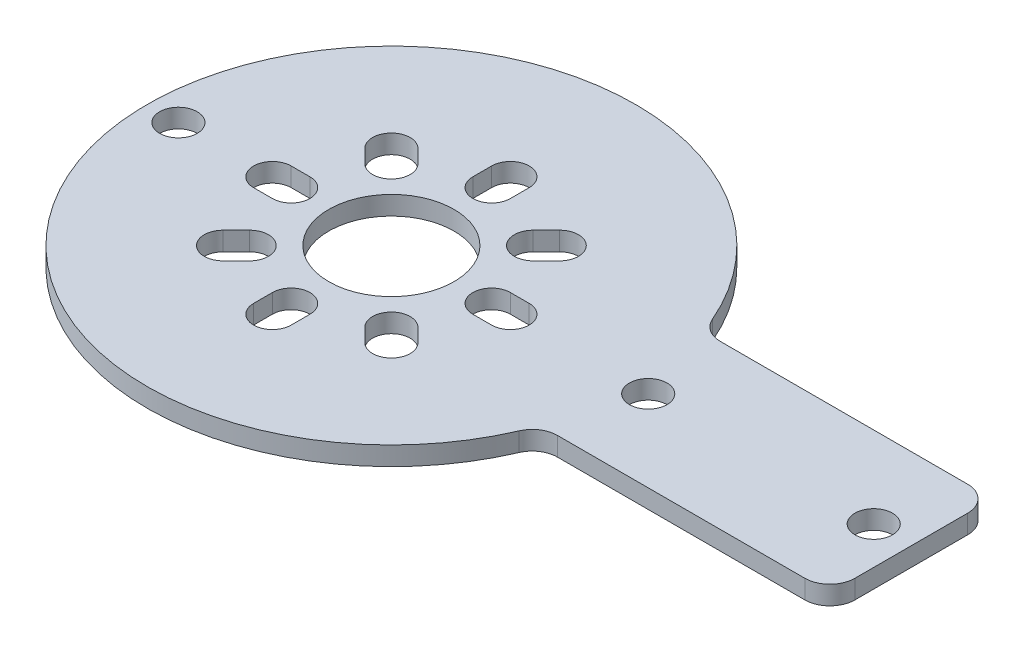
ISO-10303-21;
HEADER;
FILE_DESCRIPTION(('STEP AP214'),'2;1');
FILE_NAME('part.step','',(''),(''),'','','');
FILE_SCHEMA(('AUTOMOTIVE_DESIGN { 1 0 10303 214 1 1 1 1 }'));
ENDSEC;
DATA;
#1=APPLICATION_CONTEXT('core data for automotive mechanical design processes');
#2=APPLICATION_PROTOCOL_DEFINITION('international standard','automotive_design',2000,#1);
#3=PRODUCT_CONTEXT('',#1,'mechanical');
#4=PRODUCT('Part','Part','',(#3));
#5=PRODUCT_RELATED_PRODUCT_CATEGORY('part','',(#4));
#6=PRODUCT_DEFINITION_FORMATION('','',#4);
#7=PRODUCT_DEFINITION_CONTEXT('part definition',#1,'design');
#8=PRODUCT_DEFINITION('design','',#6,#7);
#9=PRODUCT_DEFINITION_SHAPE('','',#8);
#10=(LENGTH_UNIT() NAMED_UNIT(*) SI_UNIT(.MILLI.,.METRE.));
#11=(NAMED_UNIT(*) PLANE_ANGLE_UNIT() SI_UNIT($,.RADIAN.));
#12=(NAMED_UNIT(*) SI_UNIT($,.STERADIAN.) SOLID_ANGLE_UNIT());
#13=UNCERTAINTY_MEASURE_WITH_UNIT(LENGTH_MEASURE(1.E-05),#10,'distance_accuracy_value','');
#14=(GEOMETRIC_REPRESENTATION_CONTEXT(3) GLOBAL_UNCERTAINTY_ASSIGNED_CONTEXT((#13)) GLOBAL_UNIT_ASSIGNED_CONTEXT((#10,
#11,#12)) REPRESENTATION_CONTEXT('',''));
#15=CARTESIAN_POINT('',(0.,0.,0.));
#16=DIRECTION('',(0.,0.,1.));
#17=DIRECTION('',(1.,0.,0.));
#18=AXIS2_PLACEMENT_3D('',#15,#16,#17);
#19=CARTESIAN_POINT('',(19.7484176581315,1.5,8.5));
#20=DIRECTION('',(0.,-1.,0.));
#21=DIRECTION('',(0.,0.,-1.));
#22=AXIS2_PLACEMENT_3D('',#19,#20,#21);
#23=CYLINDRICAL_SURFACE('',#22,2.);
#24=CARTESIAN_POINT('',(19.7484176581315,0.,8.5));
#25=DIRECTION('',(0.,-1.,0.));
#26=DIRECTION('',(0.,0.,1.));
#27=AXIS2_PLACEMENT_3D('',#24,#25,#26);
#28=CIRCLE('',#27,2.);
#29=CARTESIAN_POINT('',(17.9113555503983,0.,7.7093023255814));
#30=VERTEX_POINT('',#29);
#31=CARTESIAN_POINT('',(19.7484176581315,0.,6.5));
#32=VERTEX_POINT('',#31);
#33=EDGE_CURVE('E561',#30,#32,#28,.T.);
#34=ORIENTED_EDGE('',*,*,#33,.T.);
#35=DIRECTION('',(0.,-1.,0.));
#36=VECTOR('',#35,1.);
#37=CARTESIAN_POINT('',(19.7484176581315,1.5,6.5));
#38=LINE('',#37,#36);
#39=CARTESIAN_POINT('',(19.7484176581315,1.5,6.5));
#40=VERTEX_POINT('',#39);
#41=EDGE_CURVE('E11',#40,#32,#38,.T.);
#42=ORIENTED_EDGE('',*,*,#41,.F.);
#43=CARTESIAN_POINT('',(19.7484176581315,1.5,8.5));
#44=DIRECTION('',(0.,-1.,0.));
#45=DIRECTION('',(0.,0.,1.));
#46=AXIS2_PLACEMENT_3D('',#43,#44,#45);
#47=CIRCLE('',#46,2.);
#48=CARTESIAN_POINT('',(17.9113555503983,1.5,7.7093023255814));
#49=VERTEX_POINT('',#48);
#50=EDGE_CURVE('E564',#49,#40,#47,.T.);
#51=ORIENTED_EDGE('',*,*,#50,.F.);
#52=DIRECTION('',(0.,-1.,0.));
#53=VECTOR('',#52,1.);
#54=CARTESIAN_POINT('',(17.9113555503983,1.5,7.7093023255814));
#55=LINE('',#54,#53);
#56=EDGE_CURVE('E582',#49,#30,#55,.T.);
#57=ORIENTED_EDGE('',*,*,#56,.T.);
#58=EDGE_LOOP('',(#34,#42,#51,#57));
#59=FACE_BOUND('',#58,.T.);
#60=ADVANCED_FACE('F37',(#59),#23,.F.);
#61=CARTESIAN_POINT('',(19.7484176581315,1.5,6.5));
#62=DIRECTION('',(0.,0.,-1.));
#63=DIRECTION('',(-1.,0.,0.));
#64=AXIS2_PLACEMENT_3D('',#61,#62,#63);
#65=PLANE('',#64);
#66=DIRECTION('',(1.,0.,0.));
#67=VECTOR('',#66,1.);
#68=CARTESIAN_POINT('',(19.7484176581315,0.,6.5));
#69=LINE('',#68,#67);
#70=CARTESIAN_POINT('',(39.5,0.,6.5));
#71=VERTEX_POINT('',#70);
#72=EDGE_CURVE('E585',#32,#71,#69,.T.);
#73=ORIENTED_EDGE('',*,*,#72,.T.);
#74=DIRECTION('',(0.,-1.,0.));
#75=VECTOR('',#74,1.);
#76=CARTESIAN_POINT('',(39.5,1.5,6.5));
#77=LINE('',#76,#75);
#78=CARTESIAN_POINT('',(39.5,1.5,6.5));
#79=VERTEX_POINT('',#78);
#80=EDGE_CURVE('E44',#79,#71,#77,.T.);
#81=ORIENTED_EDGE('',*,*,#80,.F.);
#82=DIRECTION('',(1.,0.,0.));
#83=VECTOR('',#82,1.);
#84=CARTESIAN_POINT('',(19.7484176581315,1.5,6.5));
#85=LINE('',#84,#83);
#86=EDGE_CURVE('E567',#40,#79,#85,.T.);
#87=ORIENTED_EDGE('',*,*,#86,.F.);
#88=ORIENTED_EDGE('',*,*,#41,.T.);
#89=EDGE_LOOP('',(#73,#81,#87,#88));
#90=FACE_BOUND('',#89,.T.);
#91=ADVANCED_FACE('F641',(#90),#65,.F.);
#92=CARTESIAN_POINT('',(39.5,1.5,4.5));
#93=DIRECTION('',(0.,-1.,0.));
#94=DIRECTION('',(0.,0.,-1.));
#95=AXIS2_PLACEMENT_3D('',#92,#93,#94);
#96=CYLINDRICAL_SURFACE('',#95,2.);
#97=CARTESIAN_POINT('',(39.5,0.,4.5));
#98=DIRECTION('',(0.,1.,0.));
#99=DIRECTION('',(0.,0.,1.));
#100=AXIS2_PLACEMENT_3D('',#97,#98,#99);
#101=CIRCLE('',#100,2.);
#102=CARTESIAN_POINT('',(41.5,0.,4.49999999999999));
#103=VERTEX_POINT('',#102);
#104=EDGE_CURVE('E587',#71,#103,#101,.T.);
#105=ORIENTED_EDGE('',*,*,#104,.T.);
#106=DIRECTION('',(0.,-1.,0.));
#107=VECTOR('',#106,1.);
#108=CARTESIAN_POINT('',(41.5,1.5,4.49999999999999));
#109=LINE('',#108,#107);
#110=CARTESIAN_POINT('',(41.5,1.5,4.49999999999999));
#111=VERTEX_POINT('',#110);
#112=EDGE_CURVE('E612',#111,#103,#109,.T.);
#113=ORIENTED_EDGE('',*,*,#112,.F.);
#114=CARTESIAN_POINT('',(39.5,1.5,4.5));
#115=DIRECTION('',(0.,1.,0.));
#116=DIRECTION('',(0.,0.,1.));
#117=AXIS2_PLACEMENT_3D('',#114,#115,#116);
#118=CIRCLE('',#117,2.);
#119=EDGE_CURVE('E570',#79,#111,#118,.T.);
#120=ORIENTED_EDGE('',*,*,#119,.F.);
#121=ORIENTED_EDGE('',*,*,#80,.T.);
#122=EDGE_LOOP('',(#105,#113,#120,#121));
#123=FACE_BOUND('',#122,.T.);
#124=ADVANCED_FACE('F619',(#123),#96,.T.);
#125=CARTESIAN_POINT('',(41.5,1.5,4.49999999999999));
#126=DIRECTION('',(-1.,0.,0.));
#127=DIRECTION('',(0.,0.,1.));
#128=AXIS2_PLACEMENT_3D('',#125,#126,#127);
#129=PLANE('',#128);
#130=DIRECTION('',(0.,0.,-1.));
#131=VECTOR('',#130,1.);
#132=CARTESIAN_POINT('',(41.5,0.,4.49999999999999));
#133=LINE('',#132,#131);
#134=CARTESIAN_POINT('',(41.5,0.,-4.49999999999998));
#135=VERTEX_POINT('',#134);
#136=EDGE_CURVE('E589',#103,#135,#133,.T.);
#137=ORIENTED_EDGE('',*,*,#136,.T.);
#138=DIRECTION('',(0.,-1.,0.));
#139=VECTOR('',#138,1.);
#140=CARTESIAN_POINT('',(41.5,1.5,-4.49999999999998));
#141=LINE('',#140,#139);
#142=CARTESIAN_POINT('',(41.5,1.5,-4.49999999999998));
#143=VERTEX_POINT('',#142);
#144=EDGE_CURVE('E609',#143,#135,#141,.T.);
#145=ORIENTED_EDGE('',*,*,#144,.F.);
#146=DIRECTION('',(0.,0.,-1.));
#147=VECTOR('',#146,1.);
#148=CARTESIAN_POINT('',(41.5,1.5,4.49999999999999));
#149=LINE('',#148,#147);
#150=EDGE_CURVE('E572',#111,#143,#149,.T.);
#151=ORIENTED_EDGE('',*,*,#150,.F.);
#152=ORIENTED_EDGE('',*,*,#112,.T.);
#153=EDGE_LOOP('',(#137,#145,#151,#152));
#154=FACE_BOUND('',#153,.T.);
#155=ADVANCED_FACE('F629',(#154),#129,.F.);
#156=CARTESIAN_POINT('',(39.5,1.5,-4.5));
#157=DIRECTION('',(0.,-1.,0.));
#158=DIRECTION('',(0.,0.,-1.));
#159=AXIS2_PLACEMENT_3D('',#156,#157,#158);
#160=CYLINDRICAL_SURFACE('',#159,2.);
#161=CARTESIAN_POINT('',(39.5,0.,-4.5));
#162=DIRECTION('',(0.,1.,0.));
#163=DIRECTION('',(0.,0.,-1.));
#164=AXIS2_PLACEMENT_3D('',#161,#162,#163);
#165=CIRCLE('',#164,2.);
#166=CARTESIAN_POINT('',(39.5,0.,-6.5));
#167=VERTEX_POINT('',#166);
#168=EDGE_CURVE('E591',#135,#167,#165,.T.);
#169=ORIENTED_EDGE('',*,*,#168,.T.);
#170=DIRECTION('',(0.,-1.,0.));
#171=VECTOR('',#170,1.);
#172=CARTESIAN_POINT('',(39.5,1.5,-6.5));
#173=LINE('',#172,#171);
#174=CARTESIAN_POINT('',(39.5,1.5,-6.5));
#175=VERTEX_POINT('',#174);
#176=EDGE_CURVE('E606',#175,#167,#173,.T.);
#177=ORIENTED_EDGE('',*,*,#176,.F.);
#178=CARTESIAN_POINT('',(39.5,1.5,-4.5));
#179=DIRECTION('',(0.,1.,0.));
#180=DIRECTION('',(0.,0.,-1.));
#181=AXIS2_PLACEMENT_3D('',#178,#179,#180);
#182=CIRCLE('',#181,2.);
#183=EDGE_CURVE('E574',#143,#175,#182,.T.);
#184=ORIENTED_EDGE('',*,*,#183,.F.);
#185=ORIENTED_EDGE('',*,*,#144,.T.);
#186=EDGE_LOOP('',(#169,#177,#184,#185));
#187=FACE_BOUND('',#186,.T.);
#188=ADVANCED_FACE('F633',(#187),#160,.T.);
#189=CARTESIAN_POINT('',(19.7484176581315,1.5,-6.5));
#190=DIRECTION('',(0.,0.,1.));
#191=DIRECTION('',(1.,0.,0.));
#192=AXIS2_PLACEMENT_3D('',#189,#190,#191);
#193=PLANE('',#192);
#194=DIRECTION('',(-1.,0.,0.));
#195=VECTOR('',#194,1.);
#196=CARTESIAN_POINT('',(19.7484176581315,0.,-6.5));
#197=LINE('',#196,#195);
#198=CARTESIAN_POINT('',(19.7484176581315,0.,-6.5));
#199=VERTEX_POINT('',#198);
#200=EDGE_CURVE('E593',#167,#199,#197,.T.);
#201=ORIENTED_EDGE('',*,*,#200,.T.);
#202=DIRECTION('',(0.,-1.,0.));
#203=VECTOR('',#202,1.);
#204=CARTESIAN_POINT('',(19.7484176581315,1.5,-6.5));
#205=LINE('',#204,#203);
#206=CARTESIAN_POINT('',(19.7484176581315,1.5,-6.5));
#207=VERTEX_POINT('',#206);
#208=EDGE_CURVE('E603',#207,#199,#205,.T.);
#209=ORIENTED_EDGE('',*,*,#208,.F.);
#210=DIRECTION('',(-1.,0.,0.));
#211=VECTOR('',#210,1.);
#212=CARTESIAN_POINT('',(19.7484176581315,1.5,-6.5));
#213=LINE('',#212,#211);
#214=EDGE_CURVE('E576',#175,#207,#213,.T.);
#215=ORIENTED_EDGE('',*,*,#214,.F.);
#216=ORIENTED_EDGE('',*,*,#176,.T.);
#217=EDGE_LOOP('',(#201,#209,#215,#216));
#218=FACE_BOUND('',#217,.T.);
#219=ADVANCED_FACE('F654',(#218),#193,.F.);
#220=CARTESIAN_POINT('',(19.7484176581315,1.5,-8.5));
#221=DIRECTION('',(0.,-1.,0.));
#222=DIRECTION('',(0.,0.,-1.));
#223=AXIS2_PLACEMENT_3D('',#220,#221,#222);
#224=CYLINDRICAL_SURFACE('',#223,2.);
#225=CARTESIAN_POINT('',(19.7484176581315,0.,-8.5));
#226=DIRECTION('',(0.,-1.,0.));
#227=DIRECTION('',(0.,0.,-1.));
#228=AXIS2_PLACEMENT_3D('',#225,#226,#227);
#229=CIRCLE('',#228,2.);
#230=CARTESIAN_POINT('',(17.9113555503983,0.,-7.70930232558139));
#231=VERTEX_POINT('',#230);
#232=EDGE_CURVE('E595',#199,#231,#229,.T.);
#233=ORIENTED_EDGE('',*,*,#232,.T.);
#234=DIRECTION('',(0.,-1.,0.));
#235=VECTOR('',#234,1.);
#236=CARTESIAN_POINT('',(17.9113555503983,1.5,-7.70930232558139));
#237=LINE('',#236,#235);
#238=CARTESIAN_POINT('',(17.9113555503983,1.5,-7.70930232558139));
#239=VERTEX_POINT('',#238);
#240=EDGE_CURVE('E600',#239,#231,#237,.T.);
#241=ORIENTED_EDGE('',*,*,#240,.F.);
#242=CARTESIAN_POINT('',(19.7484176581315,1.5,-8.5));
#243=DIRECTION('',(0.,-1.,0.));
#244=DIRECTION('',(0.,0.,-1.));
#245=AXIS2_PLACEMENT_3D('',#242,#243,#244);
#246=CIRCLE('',#245,2.);
#247=EDGE_CURVE('E578',#207,#239,#246,.T.);
#248=ORIENTED_EDGE('',*,*,#247,.F.);
#249=ORIENTED_EDGE('',*,*,#208,.T.);
#250=EDGE_LOOP('',(#233,#241,#248,#249));
#251=FACE_BOUND('',#250,.T.);
#252=ADVANCED_FACE('F652',(#251),#224,.F.);
#253=CARTESIAN_POINT('',(0.,1.5,0.));
#254=DIRECTION('',(0.,-1.,0.));
#255=DIRECTION('',(0.,0.,-1.));
#256=AXIS2_PLACEMENT_3D('',#253,#254,#255);
#257=CYLINDRICAL_SURFACE('',#256,19.5);
#258=CARTESIAN_POINT('',(0.,0.,0.));
#259=DIRECTION('',(0.,1.,0.));
#260=DIRECTION('',(0.,0.,1.));
#261=AXIS2_PLACEMENT_3D('',#258,#259,#260);
#262=CIRCLE('',#261,19.5);
#263=EDGE_CURVE('E568',#231,#30,#262,.T.);
#264=ORIENTED_EDGE('',*,*,#263,.T.);
#265=ORIENTED_EDGE('',*,*,#56,.F.);
#266=CARTESIAN_POINT('',(0.,1.5,0.));
#267=DIRECTION('',(0.,1.,0.));
#268=DIRECTION('',(0.,0.,1.));
#269=AXIS2_PLACEMENT_3D('',#266,#267,#268);
#270=CIRCLE('',#269,19.5);
#271=EDGE_CURVE('E580',#239,#49,#270,.T.);
#272=ORIENTED_EDGE('',*,*,#271,.F.);
#273=ORIENTED_EDGE('',*,*,#240,.T.);
#274=EDGE_LOOP('',(#264,#265,#272,#273));
#275=FACE_BOUND('',#274,.T.);
#276=ADVANCED_FACE('F647',(#275),#257,.T.);
#277=CARTESIAN_POINT('',(19.7484176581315,1.5,8.5));
#278=DIRECTION('',(0.,1.,0.));
#279=DIRECTION('',(0.,0.,1.));
#280=AXIS2_PLACEMENT_3D('',#277,#278,#279);
#281=PLANE('',#280);
#282=CARTESIAN_POINT('',(38.5,1.5,0.));
#283=DIRECTION('',(0.,1.,0.));
#284=DIRECTION('',(0.,0.,1.));
#285=AXIS2_PLACEMENT_3D('',#282,#283,#284);
#286=CIRCLE('',#285,1.5);
#287=CARTESIAN_POINT('',(38.5,1.5,1.5));
#288=VERTEX_POINT('',#287);
#289=EDGE_CURVE('E1082',#288,#288,#286,.T.);
#290=ORIENTED_EDGE('',*,*,#289,.F.);
#291=EDGE_LOOP('',(#290));
#292=FACE_BOUND('',#291,.T.);
#293=CARTESIAN_POINT('',(20.5,1.5,0.));
#294=DIRECTION('',(0.,1.,0.));
#295=DIRECTION('',(0.,0.,1.));
#296=AXIS2_PLACEMENT_3D('',#293,#294,#295);
#297=CIRCLE('',#296,1.5);
#298=CARTESIAN_POINT('',(20.5,1.5,1.5));
#299=VERTEX_POINT('',#298);
#300=EDGE_CURVE('E1084',#299,#299,#297,.T.);
#301=ORIENTED_EDGE('',*,*,#300,.F.);
#302=EDGE_LOOP('',(#301));
#303=FACE_BOUND('',#302,.T.);
#304=CARTESIAN_POINT('',(-17.,1.5,0.));
#305=DIRECTION('',(0.,1.,0.));
#306=DIRECTION('',(0.,0.,1.));
#307=AXIS2_PLACEMENT_3D('',#304,#305,#306);
#308=CIRCLE('',#307,1.5);
#309=CARTESIAN_POINT('',(-17.,1.5,1.5));
#310=VERTEX_POINT('',#309);
#311=EDGE_CURVE('E317',#310,#310,#308,.T.);
#312=ORIENTED_EDGE('',*,*,#311,.F.);
#313=EDGE_LOOP('',(#312));
#314=FACE_BOUND('',#313,.T.);
#315=CARTESIAN_POINT('',(5.65685424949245,1.5,-5.65685424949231));
#316=DIRECTION('',(0.,1.,0.));
#317=DIRECTION('',(0.,0.,1.));
#318=AXIS2_PLACEMENT_3D('',#315,#316,#317);
#319=CIRCLE('',#318,1.5);
#320=CARTESIAN_POINT('',(4.59619407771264,1.5,-6.71751442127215));
#321=VERTEX_POINT('',#320);
#322=CARTESIAN_POINT('',(6.71751442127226,1.5,-4.59619407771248));
#323=VERTEX_POINT('',#322);
#324=EDGE_CURVE('E51',#321,#323,#319,.T.);
#325=ORIENTED_EDGE('',*,*,#324,.F.);
#326=DIRECTION('',(-0.707106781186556,0.,0.707106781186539));
#327=VECTOR('',#326,1.);
#328=CARTESIAN_POINT('',(4.59619407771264,1.5,-6.71751442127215));
#329=LINE('',#328,#327);
#330=CARTESIAN_POINT('',(5.65685424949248,1.5,-7.77817459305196));
#331=VERTEX_POINT('',#330);
#332=EDGE_CURVE('E311',#331,#321,#329,.T.);
#333=ORIENTED_EDGE('',*,*,#332,.F.);
#334=CARTESIAN_POINT('',(6.71751442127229,1.5,-6.71751442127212));
#335=DIRECTION('',(0.,1.,0.));
#336=DIRECTION('',(0.,0.,1.));
#337=AXIS2_PLACEMENT_3D('',#334,#335,#336);
#338=CIRCLE('',#337,1.5);
#339=CARTESIAN_POINT('',(7.77817459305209,1.5,-5.65685424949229));
#340=VERTEX_POINT('',#339);
#341=EDGE_CURVE('E314',#340,#331,#338,.T.);
#342=ORIENTED_EDGE('',*,*,#341,.F.);
#343=DIRECTION('',(0.707106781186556,0.,-0.707106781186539));
#344=VECTOR('',#343,1.);
#345=CARTESIAN_POINT('',(6.71751442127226,1.5,-4.59619407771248));
#346=LINE('',#345,#344);
#347=EDGE_CURVE('E323',#323,#340,#346,.T.);
#348=ORIENTED_EDGE('',*,*,#347,.F.);
#349=EDGE_LOOP('',(#325,#333,#342,#348));
#350=FACE_BOUND('',#349,.T.);
#351=CARTESIAN_POINT('',(0.,1.5,-8.));
#352=DIRECTION('',(0.,1.,0.));
#353=DIRECTION('',(0.,0.,1.));
#354=AXIS2_PLACEMENT_3D('',#351,#352,#353);
#355=CIRCLE('',#354,1.5);
#356=CARTESIAN_POINT('',(-1.49999999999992,1.5,-8.00000000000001));
#357=VERTEX_POINT('',#356);
#358=CARTESIAN_POINT('',(1.50000000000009,1.5,-7.99999999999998));
#359=VERTEX_POINT('',#358);
#360=EDGE_CURVE('E330',#357,#359,#355,.T.);
#361=ORIENTED_EDGE('',*,*,#360,.F.);
#362=DIRECTION('',(0.,0.,1.));
#363=VECTOR('',#362,1.);
#364=CARTESIAN_POINT('',(-1.49999999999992,1.5,-8.00000000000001));
#365=LINE('',#364,#363);
#366=CARTESIAN_POINT('',(-1.4999999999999,1.5,-9.50000000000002));
#367=VERTEX_POINT('',#366);
#368=EDGE_CURVE('E338',#367,#357,#365,.T.);
#369=ORIENTED_EDGE('',*,*,#368,.F.);
#370=CARTESIAN_POINT('',(0.,1.5,-9.5));
#371=DIRECTION('',(0.,1.,0.));
#372=DIRECTION('',(0.,0.,1.));
#373=AXIS2_PLACEMENT_3D('',#370,#371,#372);
#374=CIRCLE('',#373,1.5);
#375=CARTESIAN_POINT('',(1.5000000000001,1.5,-9.49999999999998));
#376=VERTEX_POINT('',#375);
#377=EDGE_CURVE('E352',#376,#367,#374,.T.);
#378=ORIENTED_EDGE('',*,*,#377,.F.);
#379=DIRECTION('',(0.,0.,-1.));
#380=VECTOR('',#379,1.);
#381=CARTESIAN_POINT('',(1.50000000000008,1.5,-7.99999999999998));
#382=LINE('',#381,#380);
#383=EDGE_CURVE('E349',#359,#376,#382,.T.);
#384=ORIENTED_EDGE('',*,*,#383,.F.);
#385=EDGE_LOOP('',(#361,#369,#378,#384));
#386=FACE_BOUND('',#385,.T.);
#387=CARTESIAN_POINT('',(-5.65685424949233,1.5,-5.65685424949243));
#388=DIRECTION('',(0.,1.,0.));
#389=DIRECTION('',(0.,0.,1.));
#390=AXIS2_PLACEMENT_3D('',#387,#388,#389);
#391=CIRCLE('',#390,1.5);
#392=CARTESIAN_POINT('',(-6.71751442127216,1.5,-4.59619407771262));
#393=VERTEX_POINT('',#392);
#394=CARTESIAN_POINT('',(-4.5961940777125,1.5,-6.71751442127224));
#395=VERTEX_POINT('',#394);
#396=EDGE_CURVE('E359',#393,#395,#391,.T.);
#397=ORIENTED_EDGE('',*,*,#396,.F.);
#398=DIRECTION('',(0.707106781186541,0.,0.707106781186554));
#399=VECTOR('',#398,1.);
#400=CARTESIAN_POINT('',(-6.71751442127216,1.5,-4.59619407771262));
#401=LINE('',#400,#399);
#402=CARTESIAN_POINT('',(-7.77817459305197,1.5,-5.65685424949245));
#403=VERTEX_POINT('',#402);
#404=EDGE_CURVE('E370',#403,#393,#401,.T.);
#405=ORIENTED_EDGE('',*,*,#404,.F.);
#406=CARTESIAN_POINT('',(-6.71751442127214,1.5,-6.71751442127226));
#407=DIRECTION('',(0.,1.,0.));
#408=DIRECTION('',(0.,0.,1.));
#409=AXIS2_PLACEMENT_3D('',#406,#407,#408);
#410=CIRCLE('',#409,1.5);
#411=CARTESIAN_POINT('',(-5.65685424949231,1.5,-7.77817459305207));
#412=VERTEX_POINT('',#411);
#413=EDGE_CURVE('E384',#412,#403,#410,.T.);
#414=ORIENTED_EDGE('',*,*,#413,.F.);
#415=DIRECTION('',(-0.707106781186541,0.,-0.707106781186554));
#416=VECTOR('',#415,1.);
#417=CARTESIAN_POINT('',(-4.5961940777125,1.5,-6.71751442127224));
#418=LINE('',#417,#416);
#419=EDGE_CURVE('E381',#395,#412,#418,.T.);
#420=ORIENTED_EDGE('',*,*,#419,.F.);
#421=EDGE_LOOP('',(#397,#405,#414,#420));
#422=FACE_BOUND('',#421,.T.);
#423=CARTESIAN_POINT('',(-8.,1.5,0.));
#424=DIRECTION('',(0.,1.,0.));
#425=DIRECTION('',(0.,0.,1.));
#426=AXIS2_PLACEMENT_3D('',#423,#424,#425);
#427=CIRCLE('',#426,1.5);
#428=CARTESIAN_POINT('',(-8.00000000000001,1.5,1.49999999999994));
#429=VERTEX_POINT('',#428);
#430=CARTESIAN_POINT('',(-7.99999999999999,1.5,-1.50000000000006));
#431=VERTEX_POINT('',#430);
#432=EDGE_CURVE('E391',#429,#431,#427,.T.);
#433=ORIENTED_EDGE('',*,*,#432,.F.);
#434=DIRECTION('',(1.,0.,0.));
#435=VECTOR('',#434,1.);
#436=CARTESIAN_POINT('',(-8.00000000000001,1.5,1.49999999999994));
#437=LINE('',#436,#435);
#438=CARTESIAN_POINT('',(-9.50000000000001,1.5,1.49999999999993));
#439=VERTEX_POINT('',#438);
#440=EDGE_CURVE('E402',#439,#429,#437,.T.);
#441=ORIENTED_EDGE('',*,*,#440,.F.);
#442=CARTESIAN_POINT('',(-9.5,1.5,0.));
#443=DIRECTION('',(0.,1.,0.));
#444=DIRECTION('',(0.,0.,1.));
#445=AXIS2_PLACEMENT_3D('',#442,#443,#444);
#446=CIRCLE('',#445,1.5);
#447=CARTESIAN_POINT('',(-9.49999999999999,1.5,-1.50000000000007));
#448=VERTEX_POINT('',#447);
#449=EDGE_CURVE('E416',#448,#439,#446,.T.);
#450=ORIENTED_EDGE('',*,*,#449,.F.);
#451=DIRECTION('',(-1.,0.,0.));
#452=VECTOR('',#451,1.);
#453=CARTESIAN_POINT('',(-7.99999999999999,1.5,-1.50000000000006));
#454=LINE('',#453,#452);
#455=EDGE_CURVE('E413',#431,#448,#454,.T.);
#456=ORIENTED_EDGE('',*,*,#455,.F.);
#457=EDGE_LOOP('',(#433,#441,#450,#456));
#458=FACE_BOUND('',#457,.T.);
#459=CARTESIAN_POINT('',(-5.65685424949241,1.5,5.65685424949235));
#460=DIRECTION('',(0.,1.,0.));
#461=DIRECTION('',(0.,0.,1.));
#462=AXIS2_PLACEMENT_3D('',#459,#460,#461);
#463=CIRCLE('',#462,1.5);
#464=CARTESIAN_POINT('',(-4.59619407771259,1.5,6.71751442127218));
#465=VERTEX_POINT('',#464);
#466=CARTESIAN_POINT('',(-6.71751442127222,1.5,4.59619407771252));
#467=VERTEX_POINT('',#466);
#468=EDGE_CURVE('E423',#465,#467,#463,.T.);
#469=ORIENTED_EDGE('',*,*,#468,.F.);
#470=DIRECTION('',(0.707106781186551,0.,-0.707106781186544));
#471=VECTOR('',#470,1.);
#472=CARTESIAN_POINT('',(-4.59619407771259,1.5,6.71751442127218));
#473=LINE('',#472,#471);
#474=CARTESIAN_POINT('',(-5.65685424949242,1.5,7.77817459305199));
#475=VERTEX_POINT('',#474);
#476=EDGE_CURVE('E434',#475,#465,#473,.T.);
#477=ORIENTED_EDGE('',*,*,#476,.F.);
#478=CARTESIAN_POINT('',(-6.71751442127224,1.5,6.71751442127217));
#479=DIRECTION('',(0.,1.,0.));
#480=DIRECTION('',(0.,0.,1.));
#481=AXIS2_PLACEMENT_3D('',#478,#479,#480);
#482=CIRCLE('',#481,1.5);
#483=CARTESIAN_POINT('',(-7.77817459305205,1.5,5.65685424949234));
#484=VERTEX_POINT('',#483);
#485=EDGE_CURVE('E448',#484,#475,#482,.T.);
#486=ORIENTED_EDGE('',*,*,#485,.F.);
#487=DIRECTION('',(-0.707106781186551,0.,0.707106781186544));
#488=VECTOR('',#487,1.);
#489=CARTESIAN_POINT('',(-6.71751442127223,1.5,4.59619407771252));
#490=LINE('',#489,#488);
#491=EDGE_CURVE('E445',#467,#484,#490,.T.);
#492=ORIENTED_EDGE('',*,*,#491,.F.);
#493=EDGE_LOOP('',(#469,#477,#486,#492));
#494=FACE_BOUND('',#493,.T.);
#495=CARTESIAN_POINT('',(0.,1.5,8.));
#496=DIRECTION('',(0.,1.,0.));
#497=DIRECTION('',(0.,0.,1.));
#498=AXIS2_PLACEMENT_3D('',#495,#496,#497);
#499=CIRCLE('',#498,1.5);
#500=CARTESIAN_POINT('',(1.49999999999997,1.5,8.00000000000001));
#501=VERTEX_POINT('',#500);
#502=CARTESIAN_POINT('',(-1.50000000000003,1.5,7.99999999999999));
#503=VERTEX_POINT('',#502);
#504=EDGE_CURVE('E455',#501,#503,#499,.T.);
#505=ORIENTED_EDGE('',*,*,#504,.F.);
#506=DIRECTION('',(0.,0.,-1.));
#507=VECTOR('',#506,1.);
#508=CARTESIAN_POINT('',(1.49999999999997,1.5,8.00000000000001));
#509=LINE('',#508,#507);
#510=CARTESIAN_POINT('',(1.49999999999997,1.5,9.50000000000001));
#511=VERTEX_POINT('',#510);
#512=EDGE_CURVE('E466',#511,#501,#509,.T.);
#513=ORIENTED_EDGE('',*,*,#512,.F.);
#514=CARTESIAN_POINT('',(0.,1.5,9.5));
#515=DIRECTION('',(0.,1.,0.));
#516=DIRECTION('',(0.,0.,1.));
#517=AXIS2_PLACEMENT_3D('',#514,#515,#516);
#518=CIRCLE('',#517,1.5);
#519=CARTESIAN_POINT('',(-1.50000000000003,1.5,9.5));
#520=VERTEX_POINT('',#519);
#521=EDGE_CURVE('E480',#520,#511,#518,.T.);
#522=ORIENTED_EDGE('',*,*,#521,.F.);
#523=DIRECTION('',(0.,0.,1.));
#524=VECTOR('',#523,1.);
#525=CARTESIAN_POINT('',(-1.50000000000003,1.5,7.99999999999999));
#526=LINE('',#525,#524);
#527=EDGE_CURVE('E477',#503,#520,#526,.T.);
#528=ORIENTED_EDGE('',*,*,#527,.F.);
#529=EDGE_LOOP('',(#505,#513,#522,#528));
#530=FACE_BOUND('',#529,.T.);
#531=CARTESIAN_POINT('',(5.65685424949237,1.5,5.65685424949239));
#532=DIRECTION('',(0.,1.,0.));
#533=DIRECTION('',(0.,0.,1.));
#534=AXIS2_PLACEMENT_3D('',#531,#532,#533);
#535=CIRCLE('',#534,1.5);
#536=CARTESIAN_POINT('',(6.71751442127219,1.5,4.59619407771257));
#537=VERTEX_POINT('',#536);
#538=CARTESIAN_POINT('',(4.59619407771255,1.5,6.71751442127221));
#539=VERTEX_POINT('',#538);
#540=EDGE_CURVE('E487',#537,#539,#535,.T.);
#541=ORIENTED_EDGE('',*,*,#540,.F.);
#542=DIRECTION('',(-0.707106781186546,0.,-0.707106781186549));
#543=VECTOR('',#542,1.);
#544=CARTESIAN_POINT('',(6.71751442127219,1.5,4.59619407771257));
#545=LINE('',#544,#543);
#546=CARTESIAN_POINT('',(7.77817459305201,1.5,5.6568542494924));
#547=VERTEX_POINT('',#546);
#548=EDGE_CURVE('E498',#547,#537,#545,.T.);
#549=ORIENTED_EDGE('',*,*,#548,.F.);
#550=CARTESIAN_POINT('',(6.71751442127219,1.5,6.71751442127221));
#551=DIRECTION('',(0.,1.,0.));
#552=DIRECTION('',(0.,0.,1.));
#553=AXIS2_PLACEMENT_3D('',#550,#551,#552);
#554=CIRCLE('',#553,1.5);
#555=CARTESIAN_POINT('',(5.65685424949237,1.5,7.77817459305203));
#556=VERTEX_POINT('',#555);
#557=EDGE_CURVE('E512',#556,#547,#554,.T.);
#558=ORIENTED_EDGE('',*,*,#557,.F.);
#559=DIRECTION('',(0.707106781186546,0.,0.707106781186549));
#560=VECTOR('',#559,1.);
#561=CARTESIAN_POINT('',(4.59619407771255,1.5,6.71751442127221));
#562=LINE('',#561,#560);
#563=EDGE_CURVE('E509',#539,#556,#562,.T.);
#564=ORIENTED_EDGE('',*,*,#563,.F.);
#565=EDGE_LOOP('',(#541,#549,#558,#564));
#566=FACE_BOUND('',#565,.T.);
#567=CARTESIAN_POINT('',(8.,1.5,0.));
#568=DIRECTION('',(0.,1.,0.));
#569=DIRECTION('',(0.,0.,1.));
#570=AXIS2_PLACEMENT_3D('',#567,#568,#569);
#571=CIRCLE('',#570,1.5);
#572=CARTESIAN_POINT('',(8.,1.5,-1.5));
#573=VERTEX_POINT('',#572);
#574=CARTESIAN_POINT('',(8.,1.5,1.5));
#575=VERTEX_POINT('',#574);
#576=EDGE_CURVE('E519',#573,#575,#571,.T.);
#577=ORIENTED_EDGE('',*,*,#576,.F.);
#578=DIRECTION('',(-1.,0.,0.));
#579=VECTOR('',#578,1.);
#580=CARTESIAN_POINT('',(8.,1.5,-1.5));
#581=LINE('',#580,#579);
#582=CARTESIAN_POINT('',(9.5,1.5,-1.5));
#583=VERTEX_POINT('',#582);
#584=EDGE_CURVE('E530',#583,#573,#581,.T.);
#585=ORIENTED_EDGE('',*,*,#584,.F.);
#586=CARTESIAN_POINT('',(9.5,1.5,0.));
#587=DIRECTION('',(0.,1.,0.));
#588=DIRECTION('',(0.,0.,1.));
#589=AXIS2_PLACEMENT_3D('',#586,#587,#588);
#590=CIRCLE('',#589,1.5);
#591=CARTESIAN_POINT('',(9.5,1.5,1.5));
#592=VERTEX_POINT('',#591);
#593=EDGE_CURVE('E544',#592,#583,#590,.T.);
#594=ORIENTED_EDGE('',*,*,#593,.F.);
#595=DIRECTION('',(1.,0.,0.));
#596=VECTOR('',#595,1.);
#597=CARTESIAN_POINT('',(8.,1.5,1.5));
#598=LINE('',#597,#596);
#599=EDGE_CURVE('E541',#575,#592,#598,.T.);
#600=ORIENTED_EDGE('',*,*,#599,.F.);
#601=EDGE_LOOP('',(#577,#585,#594,#600));
#602=FACE_BOUND('',#601,.T.);
#603=CARTESIAN_POINT('',(0.,1.5,0.));
#604=DIRECTION('',(0.,1.,0.));
#605=DIRECTION('',(0.,0.,1.));
#606=AXIS2_PLACEMENT_3D('',#603,#604,#605);
#607=CIRCLE('',#606,5.);
#608=CARTESIAN_POINT('',(0.,1.5,5.));
#609=VERTEX_POINT('',#608);
#610=EDGE_CURVE('E551',#609,#609,#607,.T.);
#611=ORIENTED_EDGE('',*,*,#610,.F.);
#612=EDGE_LOOP('',(#611));
#613=FACE_BOUND('',#612,.T.);
#614=ORIENTED_EDGE('',*,*,#50,.T.);
#615=ORIENTED_EDGE('',*,*,#86,.T.);
#616=ORIENTED_EDGE('',*,*,#119,.T.);
#617=ORIENTED_EDGE('',*,*,#150,.T.);
#618=ORIENTED_EDGE('',*,*,#183,.T.);
#619=ORIENTED_EDGE('',*,*,#214,.T.);
#620=ORIENTED_EDGE('',*,*,#247,.T.);
#621=ORIENTED_EDGE('',*,*,#271,.T.);
#622=EDGE_LOOP('',(#614,#615,#616,#617,#618,#619,#620,#621));
#623=FACE_BOUND('',#622,.T.);
#624=ADVANCED_FACE('F637',(#292,#303,#314,#350,#386,#422,#458,#494,#530,#566,#602,#613,#623),
#281,.T.);
#625=CARTESIAN_POINT('',(19.7484176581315,0.,8.5));
#626=DIRECTION('',(0.,1.,0.));
#627=DIRECTION('',(0.,0.,1.));
#628=AXIS2_PLACEMENT_3D('',#625,#626,#627);
#629=PLANE('',#628);
#630=CARTESIAN_POINT('',(38.5,0.,0.));
#631=DIRECTION('',(0.,1.,0.));
#632=DIRECTION('',(0.,0.,1.));
#633=AXIS2_PLACEMENT_3D('',#630,#631,#632);
#634=CIRCLE('',#633,1.5);
#635=CARTESIAN_POINT('',(38.5,0.,1.5));
#636=VERTEX_POINT('',#635);
#637=EDGE_CURVE('E1079',#636,#636,#634,.T.);
#638=ORIENTED_EDGE('',*,*,#637,.T.);
#639=EDGE_LOOP('',(#638));
#640=FACE_BOUND('',#639,.T.);
#641=CARTESIAN_POINT('',(20.5,0.,0.));
#642=DIRECTION('',(0.,1.,0.));
#643=DIRECTION('',(0.,0.,1.));
#644=AXIS2_PLACEMENT_3D('',#641,#642,#643);
#645=CIRCLE('',#644,1.5);
#646=CARTESIAN_POINT('',(20.5,0.,1.5));
#647=VERTEX_POINT('',#646);
#648=EDGE_CURVE('E1087',#647,#647,#645,.T.);
#649=ORIENTED_EDGE('',*,*,#648,.T.);
#650=EDGE_LOOP('',(#649));
#651=FACE_BOUND('',#650,.T.);
#652=CARTESIAN_POINT('',(-17.,0.,0.));
#653=DIRECTION('',(0.,1.,0.));
#654=DIRECTION('',(0.,0.,1.));
#655=AXIS2_PLACEMENT_3D('',#652,#653,#654);
#656=CIRCLE('',#655,1.5);
#657=CARTESIAN_POINT('',(-17.,0.,1.5));
#658=VERTEX_POINT('',#657);
#659=EDGE_CURVE('E324',#658,#658,#656,.T.);
#660=ORIENTED_EDGE('',*,*,#659,.T.);
#661=EDGE_LOOP('',(#660));
#662=FACE_BOUND('',#661,.T.);
#663=DIRECTION('',(-0.707106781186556,0.,0.707106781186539));
#664=VECTOR('',#663,1.);
#665=CARTESIAN_POINT('',(4.59619407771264,0.,-6.71751442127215));
#666=LINE('',#665,#664);
#667=CARTESIAN_POINT('',(5.65685424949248,0.,-7.77817459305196));
#668=VERTEX_POINT('',#667);
#669=CARTESIAN_POINT('',(4.59619407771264,0.,-6.71751442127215));
#670=VERTEX_POINT('',#669);
#671=EDGE_CURVE('E301',#668,#670,#666,.T.);
#672=ORIENTED_EDGE('',*,*,#671,.T.);
#673=CARTESIAN_POINT('',(5.65685424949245,0.,-5.65685424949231));
#674=DIRECTION('',(0.,1.,0.));
#675=DIRECTION('',(0.,0.,1.));
#676=AXIS2_PLACEMENT_3D('',#673,#674,#675);
#677=CIRCLE('',#676,1.5);
#678=CARTESIAN_POINT('',(6.71751442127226,0.,-4.59619407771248));
#679=VERTEX_POINT('',#678);
#680=EDGE_CURVE('E295',#670,#679,#677,.T.);
#681=ORIENTED_EDGE('',*,*,#680,.T.);
#682=DIRECTION('',(0.707106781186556,0.,-0.707106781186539));
#683=VECTOR('',#682,1.);
#684=CARTESIAN_POINT('',(6.71751442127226,0.,-4.59619407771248));
#685=LINE('',#684,#683);
#686=CARTESIAN_POINT('',(7.77817459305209,0.,-5.65685424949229));
#687=VERTEX_POINT('',#686);
#688=EDGE_CURVE('E304',#679,#687,#685,.T.);
#689=ORIENTED_EDGE('',*,*,#688,.T.);
#690=CARTESIAN_POINT('',(6.71751442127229,0.,-6.71751442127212));
#691=DIRECTION('',(0.,1.,0.));
#692=DIRECTION('',(0.,0.,1.));
#693=AXIS2_PLACEMENT_3D('',#690,#691,#692);
#694=CIRCLE('',#693,1.5);
#695=EDGE_CURVE('E59',#687,#668,#694,.T.);
#696=ORIENTED_EDGE('',*,*,#695,.T.);
#697=EDGE_LOOP('',(#672,#681,#689,#696));
#698=FACE_BOUND('',#697,.T.);
#699=DIRECTION('',(0.,0.,1.));
#700=VECTOR('',#699,1.);
#701=CARTESIAN_POINT('',(-1.49999999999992,0.,-8.00000000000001));
#702=LINE('',#701,#700);
#703=CARTESIAN_POINT('',(-1.4999999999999,0.,-9.50000000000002));
#704=VERTEX_POINT('',#703);
#705=CARTESIAN_POINT('',(-1.49999999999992,0.,-8.00000000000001));
#706=VERTEX_POINT('',#705);
#707=EDGE_CURVE('E344',#704,#706,#702,.T.);
#708=ORIENTED_EDGE('',*,*,#707,.T.);
#709=CARTESIAN_POINT('',(0.,0.,-8.));
#710=DIRECTION('',(0.,1.,0.));
#711=DIRECTION('',(0.,0.,1.));
#712=AXIS2_PLACEMENT_3D('',#709,#710,#711);
#713=CIRCLE('',#712,1.5);
#714=CARTESIAN_POINT('',(1.50000000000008,0.,-7.99999999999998));
#715=VERTEX_POINT('',#714);
#716=EDGE_CURVE('E334',#706,#715,#713,.T.);
#717=ORIENTED_EDGE('',*,*,#716,.T.);
#718=DIRECTION('',(0.,0.,-1.));
#719=VECTOR('',#718,1.);
#720=CARTESIAN_POINT('',(1.50000000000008,0.,-7.99999999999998));
#721=LINE('',#720,#719);
#722=CARTESIAN_POINT('',(1.5000000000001,0.,-9.49999999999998));
#723=VERTEX_POINT('',#722);
#724=EDGE_CURVE('E337',#715,#723,#721,.T.);
#725=ORIENTED_EDGE('',*,*,#724,.T.);
#726=CARTESIAN_POINT('',(0.,0.,-9.5));
#727=DIRECTION('',(0.,1.,0.));
#728=DIRECTION('',(0.,0.,1.));
#729=AXIS2_PLACEMENT_3D('',#726,#727,#728);
#730=CIRCLE('',#729,1.5);
#731=EDGE_CURVE('E341',#723,#704,#730,.T.);
#732=ORIENTED_EDGE('',*,*,#731,.T.);
#733=EDGE_LOOP('',(#708,#717,#725,#732));
#734=FACE_BOUND('',#733,.T.);
#735=DIRECTION('',(0.707106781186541,0.,0.707106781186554));
#736=VECTOR('',#735,1.);
#737=CARTESIAN_POINT('',(-6.71751442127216,0.,-4.59619407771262));
#738=LINE('',#737,#736);
#739=CARTESIAN_POINT('',(-7.77817459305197,0.,-5.65685424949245));
#740=VERTEX_POINT('',#739);
#741=CARTESIAN_POINT('',(-6.71751442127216,0.,-4.59619407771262));
#742=VERTEX_POINT('',#741);
#743=EDGE_CURVE('E376',#740,#742,#738,.T.);
#744=ORIENTED_EDGE('',*,*,#743,.T.);
#745=CARTESIAN_POINT('',(-5.65685424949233,0.,-5.65685424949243));
#746=DIRECTION('',(0.,1.,0.));
#747=DIRECTION('',(0.,0.,1.));
#748=AXIS2_PLACEMENT_3D('',#745,#746,#747);
#749=CIRCLE('',#748,1.5);
#750=CARTESIAN_POINT('',(-4.5961940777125,0.,-6.71751442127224));
#751=VERTEX_POINT('',#750);
#752=EDGE_CURVE('E366',#742,#751,#749,.T.);
#753=ORIENTED_EDGE('',*,*,#752,.T.);
#754=DIRECTION('',(-0.707106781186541,0.,-0.707106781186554));
#755=VECTOR('',#754,1.);
#756=CARTESIAN_POINT('',(-4.5961940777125,0.,-6.71751442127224));
#757=LINE('',#756,#755);
#758=CARTESIAN_POINT('',(-5.65685424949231,0.,-7.77817459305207));
#759=VERTEX_POINT('',#758);
#760=EDGE_CURVE('E369',#751,#759,#757,.T.);
#761=ORIENTED_EDGE('',*,*,#760,.T.);
#762=CARTESIAN_POINT('',(-6.71751442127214,0.,-6.71751442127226));
#763=DIRECTION('',(0.,1.,0.));
#764=DIRECTION('',(0.,0.,1.));
#765=AXIS2_PLACEMENT_3D('',#762,#763,#764);
#766=CIRCLE('',#765,1.5);
#767=EDGE_CURVE('E373',#759,#740,#766,.T.);
#768=ORIENTED_EDGE('',*,*,#767,.T.);
#769=EDGE_LOOP('',(#744,#753,#761,#768));
#770=FACE_BOUND('',#769,.T.);
#771=DIRECTION('',(1.,0.,0.));
#772=VECTOR('',#771,1.);
#773=CARTESIAN_POINT('',(-8.00000000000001,0.,1.49999999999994));
#774=LINE('',#773,#772);
#775=CARTESIAN_POINT('',(-9.50000000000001,0.,1.49999999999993));
#776=VERTEX_POINT('',#775);
#777=CARTESIAN_POINT('',(-8.00000000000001,0.,1.49999999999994));
#778=VERTEX_POINT('',#777);
#779=EDGE_CURVE('E408',#776,#778,#774,.T.);
#780=ORIENTED_EDGE('',*,*,#779,.T.);
#781=CARTESIAN_POINT('',(-8.,0.,0.));
#782=DIRECTION('',(0.,1.,0.));
#783=DIRECTION('',(0.,0.,1.));
#784=AXIS2_PLACEMENT_3D('',#781,#782,#783);
#785=CIRCLE('',#784,1.5);
#786=CARTESIAN_POINT('',(-7.99999999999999,0.,-1.50000000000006));
#787=VERTEX_POINT('',#786);
#788=EDGE_CURVE('E398',#778,#787,#785,.T.);
#789=ORIENTED_EDGE('',*,*,#788,.T.);
#790=DIRECTION('',(-1.,0.,0.));
#791=VECTOR('',#790,1.);
#792=CARTESIAN_POINT('',(-7.99999999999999,0.,-1.50000000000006));
#793=LINE('',#792,#791);
#794=CARTESIAN_POINT('',(-9.49999999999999,0.,-1.50000000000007));
#795=VERTEX_POINT('',#794);
#796=EDGE_CURVE('E401',#787,#795,#793,.T.);
#797=ORIENTED_EDGE('',*,*,#796,.T.);
#798=CARTESIAN_POINT('',(-9.5,0.,0.));
#799=DIRECTION('',(0.,1.,0.));
#800=DIRECTION('',(0.,0.,1.));
#801=AXIS2_PLACEMENT_3D('',#798,#799,#800);
#802=CIRCLE('',#801,1.5);
#803=EDGE_CURVE('E405',#795,#776,#802,.T.);
#804=ORIENTED_EDGE('',*,*,#803,.T.);
#805=EDGE_LOOP('',(#780,#789,#797,#804));
#806=FACE_BOUND('',#805,.T.);
#807=DIRECTION('',(0.707106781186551,0.,-0.707106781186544));
#808=VECTOR('',#807,1.);
#809=CARTESIAN_POINT('',(-4.59619407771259,0.,6.71751442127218));
#810=LINE('',#809,#808);
#811=CARTESIAN_POINT('',(-5.65685424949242,0.,7.77817459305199));
#812=VERTEX_POINT('',#811);
#813=CARTESIAN_POINT('',(-4.59619407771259,0.,6.71751442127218));
#814=VERTEX_POINT('',#813);
#815=EDGE_CURVE('E440',#812,#814,#810,.T.);
#816=ORIENTED_EDGE('',*,*,#815,.T.);
#817=CARTESIAN_POINT('',(-5.65685424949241,0.,5.65685424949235));
#818=DIRECTION('',(0.,1.,0.));
#819=DIRECTION('',(0.,0.,1.));
#820=AXIS2_PLACEMENT_3D('',#817,#818,#819);
#821=CIRCLE('',#820,1.5);
#822=CARTESIAN_POINT('',(-6.71751442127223,0.,4.59619407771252));
#823=VERTEX_POINT('',#822);
#824=EDGE_CURVE('E430',#814,#823,#821,.T.);
#825=ORIENTED_EDGE('',*,*,#824,.T.);
#826=DIRECTION('',(-0.707106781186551,0.,0.707106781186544));
#827=VECTOR('',#826,1.);
#828=CARTESIAN_POINT('',(-6.71751442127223,0.,4.59619407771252));
#829=LINE('',#828,#827);
#830=CARTESIAN_POINT('',(-7.77817459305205,0.,5.65685424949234));
#831=VERTEX_POINT('',#830);
#832=EDGE_CURVE('E433',#823,#831,#829,.T.);
#833=ORIENTED_EDGE('',*,*,#832,.T.);
#834=CARTESIAN_POINT('',(-6.71751442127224,0.,6.71751442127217));
#835=DIRECTION('',(0.,1.,0.));
#836=DIRECTION('',(0.,0.,1.));
#837=AXIS2_PLACEMENT_3D('',#834,#835,#836);
#838=CIRCLE('',#837,1.5);
#839=EDGE_CURVE('E437',#831,#812,#838,.T.);
#840=ORIENTED_EDGE('',*,*,#839,.T.);
#841=EDGE_LOOP('',(#816,#825,#833,#840));
#842=FACE_BOUND('',#841,.T.);
#843=DIRECTION('',(0.,0.,-1.));
#844=VECTOR('',#843,1.);
#845=CARTESIAN_POINT('',(1.49999999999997,0.,8.00000000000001));
#846=LINE('',#845,#844);
#847=CARTESIAN_POINT('',(1.49999999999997,0.,9.50000000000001));
#848=VERTEX_POINT('',#847);
#849=CARTESIAN_POINT('',(1.49999999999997,0.,8.00000000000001));
#850=VERTEX_POINT('',#849);
#851=EDGE_CURVE('E472',#848,#850,#846,.T.);
#852=ORIENTED_EDGE('',*,*,#851,.T.);
#853=CARTESIAN_POINT('',(0.,0.,8.));
#854=DIRECTION('',(0.,1.,0.));
#855=DIRECTION('',(0.,0.,1.));
#856=AXIS2_PLACEMENT_3D('',#853,#854,#855);
#857=CIRCLE('',#856,1.5);
#858=CARTESIAN_POINT('',(-1.50000000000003,0.,7.99999999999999));
#859=VERTEX_POINT('',#858);
#860=EDGE_CURVE('E462',#850,#859,#857,.T.);
#861=ORIENTED_EDGE('',*,*,#860,.T.);
#862=DIRECTION('',(0.,0.,1.));
#863=VECTOR('',#862,1.);
#864=CARTESIAN_POINT('',(-1.50000000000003,0.,7.99999999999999));
#865=LINE('',#864,#863);
#866=CARTESIAN_POINT('',(-1.50000000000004,0.,9.5));
#867=VERTEX_POINT('',#866);
#868=EDGE_CURVE('E465',#859,#867,#865,.T.);
#869=ORIENTED_EDGE('',*,*,#868,.T.);
#870=CARTESIAN_POINT('',(0.,0.,9.5));
#871=DIRECTION('',(0.,1.,0.));
#872=DIRECTION('',(0.,0.,1.));
#873=AXIS2_PLACEMENT_3D('',#870,#871,#872);
#874=CIRCLE('',#873,1.5);
#875=EDGE_CURVE('E469',#867,#848,#874,.T.);
#876=ORIENTED_EDGE('',*,*,#875,.T.);
#877=EDGE_LOOP('',(#852,#861,#869,#876));
#878=FACE_BOUND('',#877,.T.);
#879=DIRECTION('',(-0.707106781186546,0.,-0.707106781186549));
#880=VECTOR('',#879,1.);
#881=CARTESIAN_POINT('',(6.71751442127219,0.,4.59619407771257));
#882=LINE('',#881,#880);
#883=CARTESIAN_POINT('',(7.77817459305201,0.,5.6568542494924));
#884=VERTEX_POINT('',#883);
#885=CARTESIAN_POINT('',(6.71751442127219,0.,4.59619407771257));
#886=VERTEX_POINT('',#885);
#887=EDGE_CURVE('E504',#884,#886,#882,.T.);
#888=ORIENTED_EDGE('',*,*,#887,.T.);
#889=CARTESIAN_POINT('',(5.65685424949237,0.,5.65685424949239));
#890=DIRECTION('',(0.,1.,0.));
#891=DIRECTION('',(0.,0.,1.));
#892=AXIS2_PLACEMENT_3D('',#889,#890,#891);
#893=CIRCLE('',#892,1.5);
#894=CARTESIAN_POINT('',(4.59619407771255,0.,6.71751442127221));
#895=VERTEX_POINT('',#894);
#896=EDGE_CURVE('E494',#886,#895,#893,.T.);
#897=ORIENTED_EDGE('',*,*,#896,.T.);
#898=DIRECTION('',(0.707106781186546,0.,0.707106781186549));
#899=VECTOR('',#898,1.);
#900=CARTESIAN_POINT('',(4.59619407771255,0.,6.71751442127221));
#901=LINE('',#900,#899);
#902=CARTESIAN_POINT('',(5.65685424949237,0.,7.77817459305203));
#903=VERTEX_POINT('',#902);
#904=EDGE_CURVE('E497',#895,#903,#901,.T.);
#905=ORIENTED_EDGE('',*,*,#904,.T.);
#906=CARTESIAN_POINT('',(6.71751442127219,0.,6.71751442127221));
#907=DIRECTION('',(0.,1.,0.));
#908=DIRECTION('',(0.,0.,1.));
#909=AXIS2_PLACEMENT_3D('',#906,#907,#908);
#910=CIRCLE('',#909,1.5);
#911=EDGE_CURVE('E501',#903,#884,#910,.T.);
#912=ORIENTED_EDGE('',*,*,#911,.T.);
#913=EDGE_LOOP('',(#888,#897,#905,#912));
#914=FACE_BOUND('',#913,.T.);
#915=DIRECTION('',(-1.,0.,0.));
#916=VECTOR('',#915,1.);
#917=CARTESIAN_POINT('',(8.,0.,-1.5));
#918=LINE('',#917,#916);
#919=CARTESIAN_POINT('',(9.5,0.,-1.5));
#920=VERTEX_POINT('',#919);
#921=CARTESIAN_POINT('',(8.,0.,-1.5));
#922=VERTEX_POINT('',#921);
#923=EDGE_CURVE('E536',#920,#922,#918,.T.);
#924=ORIENTED_EDGE('',*,*,#923,.T.);
#925=CARTESIAN_POINT('',(8.,0.,0.));
#926=DIRECTION('',(0.,1.,0.));
#927=DIRECTION('',(0.,0.,1.));
#928=AXIS2_PLACEMENT_3D('',#925,#926,#927);
#929=CIRCLE('',#928,1.5);
#930=CARTESIAN_POINT('',(8.,0.,1.5));
#931=VERTEX_POINT('',#930);
#932=EDGE_CURVE('E526',#922,#931,#929,.T.);
#933=ORIENTED_EDGE('',*,*,#932,.T.);
#934=DIRECTION('',(1.,0.,0.));
#935=VECTOR('',#934,1.);
#936=CARTESIAN_POINT('',(8.,0.,1.5));
#937=LINE('',#936,#935);
#938=CARTESIAN_POINT('',(9.5,0.,1.5));
#939=VERTEX_POINT('',#938);
#940=EDGE_CURVE('E529',#931,#939,#937,.T.);
#941=ORIENTED_EDGE('',*,*,#940,.T.);
#942=CARTESIAN_POINT('',(9.5,0.,0.));
#943=DIRECTION('',(0.,1.,0.));
#944=DIRECTION('',(0.,0.,1.));
#945=AXIS2_PLACEMENT_3D('',#942,#943,#944);
#946=CIRCLE('',#945,1.5);
#947=EDGE_CURVE('E533',#939,#920,#946,.T.);
#948=ORIENTED_EDGE('',*,*,#947,.T.);
#949=EDGE_LOOP('',(#924,#933,#941,#948));
#950=FACE_BOUND('',#949,.T.);
#951=CARTESIAN_POINT('',(0.,0.,0.));
#952=DIRECTION('',(0.,1.,0.));
#953=DIRECTION('',(0.,0.,1.));
#954=AXIS2_PLACEMENT_3D('',#951,#952,#953);
#955=CIRCLE('',#954,5.);
#956=CARTESIAN_POINT('',(0.,0.,5.));
#957=VERTEX_POINT('',#956);
#958=EDGE_CURVE('E558',#957,#957,#955,.T.);
#959=ORIENTED_EDGE('',*,*,#958,.T.);
#960=EDGE_LOOP('',(#959));
#961=FACE_BOUND('',#960,.T.);
#962=ORIENTED_EDGE('',*,*,#33,.F.);
#963=ORIENTED_EDGE('',*,*,#263,.F.);
#964=ORIENTED_EDGE('',*,*,#232,.F.);
#965=ORIENTED_EDGE('',*,*,#200,.F.);
#966=ORIENTED_EDGE('',*,*,#168,.F.);
#967=ORIENTED_EDGE('',*,*,#136,.F.);
#968=ORIENTED_EDGE('',*,*,#104,.F.);
#969=ORIENTED_EDGE('',*,*,#72,.F.);
#970=EDGE_LOOP('',(#962,#963,#964,#965,#966,#967,#968,#969));
#971=FACE_BOUND('',#970,.T.);
#972=ADVANCED_FACE('F308',(#640,#651,#662,#698,#734,#770,#806,#842,#878,#914,#950,#961,#971),
#629,.F.);
#973=CARTESIAN_POINT('',(0.,0.,0.));
#974=DIRECTION('',(0.,1.,0.));
#975=DIRECTION('',(0.,0.,1.));
#976=AXIS2_PLACEMENT_3D('',#973,#974,#975);
#977=CYLINDRICAL_SURFACE('',#976,5.);
#978=ORIENTED_EDGE('',*,*,#958,.F.);
#979=EDGE_LOOP('',(#978));
#980=FACE_BOUND('',#979,.T.);
#981=ORIENTED_EDGE('',*,*,#610,.T.);
#982=EDGE_LOOP('',(#981));
#983=FACE_BOUND('',#982,.T.);
#984=ADVANCED_FACE('F706',(#980,#983),#977,.F.);
#985=CARTESIAN_POINT('',(8.,0.,0.));
#986=DIRECTION('',(0.,1.,0.));
#987=DIRECTION('',(0.,0.,1.));
#988=AXIS2_PLACEMENT_3D('',#985,#986,#987);
#989=CYLINDRICAL_SURFACE('',#988,1.5);
#990=ORIENTED_EDGE('',*,*,#576,.T.);
#991=DIRECTION('',(0.,1.,0.));
#992=VECTOR('',#991,1.);
#993=CARTESIAN_POINT('',(8.,0.,1.5));
#994=LINE('',#993,#992);
#995=EDGE_CURVE('E539',#931,#575,#994,.T.);
#996=ORIENTED_EDGE('',*,*,#995,.F.);
#997=ORIENTED_EDGE('',*,*,#932,.F.);
#998=DIRECTION('',(0.,1.,0.));
#999=VECTOR('',#998,1.);
#1000=CARTESIAN_POINT('',(8.,0.,-1.5));
#1001=LINE('',#1000,#999);
#1002=EDGE_CURVE('E549',#922,#573,#1001,.T.);
#1003=ORIENTED_EDGE('',*,*,#1002,.T.);
#1004=EDGE_LOOP('',(#990,#996,#997,#1003));
#1005=FACE_BOUND('',#1004,.T.);
#1006=ADVANCED_FACE('F711',(#1005),#989,.F.);
#1007=CARTESIAN_POINT('',(8.,0.,-1.5));
#1008=DIRECTION('',(0.,0.,-1.));
#1009=DIRECTION('',(-1.,0.,0.));
#1010=AXIS2_PLACEMENT_3D('',#1007,#1008,#1009);
#1011=PLANE('',#1010);
#1012=ORIENTED_EDGE('',*,*,#584,.T.);
#1013=ORIENTED_EDGE('',*,*,#1002,.F.);
#1014=ORIENTED_EDGE('',*,*,#923,.F.);
#1015=DIRECTION('',(0.,1.,0.));
#1016=VECTOR('',#1015,1.);
#1017=CARTESIAN_POINT('',(9.5,0.,-1.5));
#1018=LINE('',#1017,#1016);
#1019=EDGE_CURVE('E552',#920,#583,#1018,.T.);
#1020=ORIENTED_EDGE('',*,*,#1019,.T.);
#1021=EDGE_LOOP('',(#1012,#1013,#1014,#1020));
#1022=FACE_BOUND('',#1021,.T.);
#1023=ADVANCED_FACE('F723',(#1022),#1011,.F.);
#1024=CARTESIAN_POINT('',(9.5,0.,0.));
#1025=DIRECTION('',(0.,1.,0.));
#1026=DIRECTION('',(0.,0.,1.));
#1027=AXIS2_PLACEMENT_3D('',#1024,#1025,#1026);
#1028=CYLINDRICAL_SURFACE('',#1027,1.5);
#1029=ORIENTED_EDGE('',*,*,#593,.T.);
#1030=ORIENTED_EDGE('',*,*,#1019,.F.);
#1031=ORIENTED_EDGE('',*,*,#947,.F.);
#1032=DIRECTION('',(0.,1.,0.));
#1033=VECTOR('',#1032,1.);
#1034=CARTESIAN_POINT('',(9.5,0.,1.5));
#1035=LINE('',#1034,#1033);
#1036=EDGE_CURVE('E554',#939,#592,#1035,.T.);
#1037=ORIENTED_EDGE('',*,*,#1036,.T.);
#1038=EDGE_LOOP('',(#1029,#1030,#1031,#1037));
#1039=FACE_BOUND('',#1038,.T.);
#1040=ADVANCED_FACE('F733',(#1039),#1028,.F.);
#1041=CARTESIAN_POINT('',(8.,0.,1.5));
#1042=DIRECTION('',(0.,0.,1.));
#1043=DIRECTION('',(1.,0.,0.));
#1044=AXIS2_PLACEMENT_3D('',#1041,#1042,#1043);
#1045=PLANE('',#1044);
#1046=ORIENTED_EDGE('',*,*,#599,.T.);
#1047=ORIENTED_EDGE('',*,*,#1036,.F.);
#1048=ORIENTED_EDGE('',*,*,#940,.F.);
#1049=ORIENTED_EDGE('',*,*,#995,.T.);
#1050=EDGE_LOOP('',(#1046,#1047,#1048,#1049));
#1051=FACE_BOUND('',#1050,.T.);
#1052=ADVANCED_FACE('F743',(#1051),#1045,.F.);
#1053=CARTESIAN_POINT('',(5.65685424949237,0.,5.65685424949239));
#1054=DIRECTION('',(0.,1.,0.));
#1055=DIRECTION('',(0.,0.,1.));
#1056=AXIS2_PLACEMENT_3D('',#1053,#1054,#1055);
#1057=CYLINDRICAL_SURFACE('',#1056,1.5);
#1058=ORIENTED_EDGE('',*,*,#540,.T.);
#1059=DIRECTION('',(0.,1.,0.));
#1060=VECTOR('',#1059,1.);
#1061=CARTESIAN_POINT('',(4.59619407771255,0.,6.71751442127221));
#1062=LINE('',#1061,#1060);
#1063=EDGE_CURVE('E507',#895,#539,#1062,.T.);
#1064=ORIENTED_EDGE('',*,*,#1063,.F.);
#1065=ORIENTED_EDGE('',*,*,#896,.F.);
#1066=DIRECTION('',(0.,1.,0.));
#1067=VECTOR('',#1066,1.);
#1068=CARTESIAN_POINT('',(6.71751442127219,0.,4.59619407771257));
#1069=LINE('',#1068,#1067);
#1070=EDGE_CURVE('E517',#886,#537,#1069,.T.);
#1071=ORIENTED_EDGE('',*,*,#1070,.T.);
#1072=EDGE_LOOP('',(#1058,#1064,#1065,#1071));
#1073=FACE_BOUND('',#1072,.T.);
#1074=ADVANCED_FACE('F753',(#1073),#1057,.F.);
#1075=CARTESIAN_POINT('',(6.71751442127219,0.,4.59619407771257));
#1076=DIRECTION('',(0.707106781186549,0.,-0.707106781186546));
#1077=DIRECTION('',(-0.707106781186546,0.,-0.707106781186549));
#1078=AXIS2_PLACEMENT_3D('',#1075,#1076,#1077);
#1079=PLANE('',#1078);
#1080=ORIENTED_EDGE('',*,*,#548,.T.);
#1081=ORIENTED_EDGE('',*,*,#1070,.F.);
#1082=ORIENTED_EDGE('',*,*,#887,.F.);
#1083=DIRECTION('',(0.,1.,0.));
#1084=VECTOR('',#1083,1.);
#1085=CARTESIAN_POINT('',(7.77817459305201,0.,5.6568542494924));
#1086=LINE('',#1085,#1084);
#1087=EDGE_CURVE('E520',#884,#547,#1086,.T.);
#1088=ORIENTED_EDGE('',*,*,#1087,.T.);
#1089=EDGE_LOOP('',(#1080,#1081,#1082,#1088));
#1090=FACE_BOUND('',#1089,.T.);
#1091=ADVANCED_FACE('F763',(#1090),#1079,.F.);
#1092=CARTESIAN_POINT('',(6.71751442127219,0.,6.71751442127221));
#1093=DIRECTION('',(0.,1.,0.));
#1094=DIRECTION('',(0.,0.,1.));
#1095=AXIS2_PLACEMENT_3D('',#1092,#1093,#1094);
#1096=CYLINDRICAL_SURFACE('',#1095,1.5);
#1097=ORIENTED_EDGE('',*,*,#557,.T.);
#1098=ORIENTED_EDGE('',*,*,#1087,.F.);
#1099=ORIENTED_EDGE('',*,*,#911,.F.);
#1100=DIRECTION('',(0.,1.,0.));
#1101=VECTOR('',#1100,1.);
#1102=CARTESIAN_POINT('',(5.65685424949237,0.,7.77817459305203));
#1103=LINE('',#1102,#1101);
#1104=EDGE_CURVE('E522',#903,#556,#1103,.T.);
#1105=ORIENTED_EDGE('',*,*,#1104,.T.);
#1106=EDGE_LOOP('',(#1097,#1098,#1099,#1105));
#1107=FACE_BOUND('',#1106,.T.);
#1108=ADVANCED_FACE('F773',(#1107),#1096,.F.);
#1109=CARTESIAN_POINT('',(4.59619407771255,0.,6.71751442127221));
#1110=DIRECTION('',(-0.707106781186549,0.,0.707106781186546));
#1111=DIRECTION('',(0.707106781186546,0.,0.707106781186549));
#1112=AXIS2_PLACEMENT_3D('',#1109,#1110,#1111);
#1113=PLANE('',#1112);
#1114=ORIENTED_EDGE('',*,*,#563,.T.);
#1115=ORIENTED_EDGE('',*,*,#1104,.F.);
#1116=ORIENTED_EDGE('',*,*,#904,.F.);
#1117=ORIENTED_EDGE('',*,*,#1063,.T.);
#1118=EDGE_LOOP('',(#1114,#1115,#1116,#1117));
#1119=FACE_BOUND('',#1118,.T.);
#1120=ADVANCED_FACE('F783',(#1119),#1113,.F.);
#1121=CARTESIAN_POINT('',(0.,0.,8.));
#1122=DIRECTION('',(0.,1.,0.));
#1123=DIRECTION('',(0.,0.,1.));
#1124=AXIS2_PLACEMENT_3D('',#1121,#1122,#1123);
#1125=CYLINDRICAL_SURFACE('',#1124,1.5);
#1126=ORIENTED_EDGE('',*,*,#504,.T.);
#1127=DIRECTION('',(0.,1.,0.));
#1128=VECTOR('',#1127,1.);
#1129=CARTESIAN_POINT('',(-1.50000000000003,0.,7.99999999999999));
#1130=LINE('',#1129,#1128);
#1131=EDGE_CURVE('E475',#859,#503,#1130,.T.);
#1132=ORIENTED_EDGE('',*,*,#1131,.F.);
#1133=ORIENTED_EDGE('',*,*,#860,.F.);
#1134=DIRECTION('',(0.,1.,0.));
#1135=VECTOR('',#1134,1.);
#1136=CARTESIAN_POINT('',(1.49999999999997,0.,8.00000000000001));
#1137=LINE('',#1136,#1135);
#1138=EDGE_CURVE('E485',#850,#501,#1137,.T.);
#1139=ORIENTED_EDGE('',*,*,#1138,.T.);
#1140=EDGE_LOOP('',(#1126,#1132,#1133,#1139));
#1141=FACE_BOUND('',#1140,.T.);
#1142=ADVANCED_FACE('F793',(#1141),#1125,.F.);
#1143=CARTESIAN_POINT('',(1.49999999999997,0.,8.00000000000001));
#1144=DIRECTION('',(1.,0.,0.));
#1145=DIRECTION('',(0.,0.,-1.));
#1146=AXIS2_PLACEMENT_3D('',#1143,#1144,#1145);
#1147=PLANE('',#1146);
#1148=ORIENTED_EDGE('',*,*,#512,.T.);
#1149=ORIENTED_EDGE('',*,*,#1138,.F.);
#1150=ORIENTED_EDGE('',*,*,#851,.F.);
#1151=DIRECTION('',(0.,1.,0.));
#1152=VECTOR('',#1151,1.);
#1153=CARTESIAN_POINT('',(1.49999999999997,0.,9.50000000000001));
#1154=LINE('',#1153,#1152);
#1155=EDGE_CURVE('E488',#848,#511,#1154,.T.);
#1156=ORIENTED_EDGE('',*,*,#1155,.T.);
#1157=EDGE_LOOP('',(#1148,#1149,#1150,#1156));
#1158=FACE_BOUND('',#1157,.T.);
#1159=ADVANCED_FACE('F803',(#1158),#1147,.F.);
#1160=CARTESIAN_POINT('',(0.,0.,9.5));
#1161=DIRECTION('',(0.,1.,0.));
#1162=DIRECTION('',(0.,0.,1.));
#1163=AXIS2_PLACEMENT_3D('',#1160,#1161,#1162);
#1164=CYLINDRICAL_SURFACE('',#1163,1.5);
#1165=ORIENTED_EDGE('',*,*,#521,.T.);
#1166=ORIENTED_EDGE('',*,*,#1155,.F.);
#1167=ORIENTED_EDGE('',*,*,#875,.F.);
#1168=DIRECTION('',(0.,1.,0.));
#1169=VECTOR('',#1168,1.);
#1170=CARTESIAN_POINT('',(-1.50000000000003,0.,9.5));
#1171=LINE('',#1170,#1169);
#1172=EDGE_CURVE('E490',#867,#520,#1171,.T.);
#1173=ORIENTED_EDGE('',*,*,#1172,.T.);
#1174=EDGE_LOOP('',(#1165,#1166,#1167,#1173));
#1175=FACE_BOUND('',#1174,.T.);
#1176=ADVANCED_FACE('F813',(#1175),#1164,.F.);
#1177=CARTESIAN_POINT('',(-1.50000000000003,0.,7.99999999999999));
#1178=DIRECTION('',(-1.,0.,0.));
#1179=DIRECTION('',(0.,0.,1.));
#1180=AXIS2_PLACEMENT_3D('',#1177,#1178,#1179);
#1181=PLANE('',#1180);
#1182=ORIENTED_EDGE('',*,*,#527,.T.);
#1183=ORIENTED_EDGE('',*,*,#1172,.F.);
#1184=ORIENTED_EDGE('',*,*,#868,.F.);
#1185=ORIENTED_EDGE('',*,*,#1131,.T.);
#1186=EDGE_LOOP('',(#1182,#1183,#1184,#1185));
#1187=FACE_BOUND('',#1186,.T.);
#1188=ADVANCED_FACE('F823',(#1187),#1181,.F.);
#1189=CARTESIAN_POINT('',(-5.65685424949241,0.,5.65685424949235));
#1190=DIRECTION('',(0.,1.,0.));
#1191=DIRECTION('',(0.,0.,1.));
#1192=AXIS2_PLACEMENT_3D('',#1189,#1190,#1191);
#1193=CYLINDRICAL_SURFACE('',#1192,1.5);
#1194=ORIENTED_EDGE('',*,*,#468,.T.);
#1195=DIRECTION('',(0.,1.,0.));
#1196=VECTOR('',#1195,1.);
#1197=CARTESIAN_POINT('',(-6.71751442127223,0.,4.59619407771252));
#1198=LINE('',#1197,#1196);
#1199=EDGE_CURVE('E443',#823,#467,#1198,.T.);
#1200=ORIENTED_EDGE('',*,*,#1199,.F.);
#1201=ORIENTED_EDGE('',*,*,#824,.F.);
#1202=DIRECTION('',(0.,1.,0.));
#1203=VECTOR('',#1202,1.);
#1204=CARTESIAN_POINT('',(-4.59619407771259,0.,6.71751442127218));
#1205=LINE('',#1204,#1203);
#1206=EDGE_CURVE('E453',#814,#465,#1205,.T.);
#1207=ORIENTED_EDGE('',*,*,#1206,.T.);
#1208=EDGE_LOOP('',(#1194,#1200,#1201,#1207));
#1209=FACE_BOUND('',#1208,.T.);
#1210=ADVANCED_FACE('F833',(#1209),#1193,.F.);
#1211=CARTESIAN_POINT('',(-4.59619407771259,0.,6.71751442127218));
#1212=DIRECTION('',(0.707106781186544,0.,0.707106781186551));
#1213=DIRECTION('',(0.707106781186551,0.,-0.707106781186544));
#1214=AXIS2_PLACEMENT_3D('',#1211,#1212,#1213);
#1215=PLANE('',#1214);
#1216=ORIENTED_EDGE('',*,*,#476,.T.);
#1217=ORIENTED_EDGE('',*,*,#1206,.F.);
#1218=ORIENTED_EDGE('',*,*,#815,.F.);
#1219=DIRECTION('',(0.,1.,0.));
#1220=VECTOR('',#1219,1.);
#1221=CARTESIAN_POINT('',(-5.65685424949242,0.,7.77817459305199));
#1222=LINE('',#1221,#1220);
#1223=EDGE_CURVE('E456',#812,#475,#1222,.T.);
#1224=ORIENTED_EDGE('',*,*,#1223,.T.);
#1225=EDGE_LOOP('',(#1216,#1217,#1218,#1224));
#1226=FACE_BOUND('',#1225,.T.);
#1227=ADVANCED_FACE('F843',(#1226),#1215,.F.);
#1228=CARTESIAN_POINT('',(-6.71751442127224,0.,6.71751442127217));
#1229=DIRECTION('',(0.,1.,0.));
#1230=DIRECTION('',(0.,0.,1.));
#1231=AXIS2_PLACEMENT_3D('',#1228,#1229,#1230);
#1232=CYLINDRICAL_SURFACE('',#1231,1.5);
#1233=ORIENTED_EDGE('',*,*,#485,.T.);
#1234=ORIENTED_EDGE('',*,*,#1223,.F.);
#1235=ORIENTED_EDGE('',*,*,#839,.F.);
#1236=DIRECTION('',(0.,1.,0.));
#1237=VECTOR('',#1236,1.);
#1238=CARTESIAN_POINT('',(-7.77817459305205,0.,5.65685424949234));
#1239=LINE('',#1238,#1237);
#1240=EDGE_CURVE('E458',#831,#484,#1239,.T.);
#1241=ORIENTED_EDGE('',*,*,#1240,.T.);
#1242=EDGE_LOOP('',(#1233,#1234,#1235,#1241));
#1243=FACE_BOUND('',#1242,.T.);
#1244=ADVANCED_FACE('F853',(#1243),#1232,.F.);
#1245=CARTESIAN_POINT('',(-6.71751442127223,0.,4.59619407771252));
#1246=DIRECTION('',(-0.707106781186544,0.,-0.707106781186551));
#1247=DIRECTION('',(-0.707106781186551,0.,0.707106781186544));
#1248=AXIS2_PLACEMENT_3D('',#1245,#1246,#1247);
#1249=PLANE('',#1248);
#1250=ORIENTED_EDGE('',*,*,#491,.T.);
#1251=ORIENTED_EDGE('',*,*,#1240,.F.);
#1252=ORIENTED_EDGE('',*,*,#832,.F.);
#1253=ORIENTED_EDGE('',*,*,#1199,.T.);
#1254=EDGE_LOOP('',(#1250,#1251,#1252,#1253));
#1255=FACE_BOUND('',#1254,.T.);
#1256=ADVANCED_FACE('F863',(#1255),#1249,.F.);
#1257=CARTESIAN_POINT('',(-8.,0.,0.));
#1258=DIRECTION('',(0.,1.,0.));
#1259=DIRECTION('',(0.,0.,1.));
#1260=AXIS2_PLACEMENT_3D('',#1257,#1258,#1259);
#1261=CYLINDRICAL_SURFACE('',#1260,1.5);
#1262=ORIENTED_EDGE('',*,*,#432,.T.);
#1263=DIRECTION('',(0.,1.,0.));
#1264=VECTOR('',#1263,1.);
#1265=CARTESIAN_POINT('',(-7.99999999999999,0.,-1.50000000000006));
#1266=LINE('',#1265,#1264);
#1267=EDGE_CURVE('E411',#787,#431,#1266,.T.);
#1268=ORIENTED_EDGE('',*,*,#1267,.F.);
#1269=ORIENTED_EDGE('',*,*,#788,.F.);
#1270=DIRECTION('',(0.,1.,0.));
#1271=VECTOR('',#1270,1.);
#1272=CARTESIAN_POINT('',(-8.00000000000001,0.,1.49999999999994));
#1273=LINE('',#1272,#1271);
#1274=EDGE_CURVE('E421',#778,#429,#1273,.T.);
#1275=ORIENTED_EDGE('',*,*,#1274,.T.);
#1276=EDGE_LOOP('',(#1262,#1268,#1269,#1275));
#1277=FACE_BOUND('',#1276,.T.);
#1278=ADVANCED_FACE('F873',(#1277),#1261,.F.);
#1279=CARTESIAN_POINT('',(-8.00000000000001,0.,1.49999999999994));
#1280=DIRECTION('',(0.,0.,1.));
#1281=DIRECTION('',(1.,0.,0.));
#1282=AXIS2_PLACEMENT_3D('',#1279,#1280,#1281);
#1283=PLANE('',#1282);
#1284=ORIENTED_EDGE('',*,*,#440,.T.);
#1285=ORIENTED_EDGE('',*,*,#1274,.F.);
#1286=ORIENTED_EDGE('',*,*,#779,.F.);
#1287=DIRECTION('',(0.,1.,0.));
#1288=VECTOR('',#1287,1.);
#1289=CARTESIAN_POINT('',(-9.50000000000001,0.,1.49999999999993));
#1290=LINE('',#1289,#1288);
#1291=EDGE_CURVE('E424',#776,#439,#1290,.T.);
#1292=ORIENTED_EDGE('',*,*,#1291,.T.);
#1293=EDGE_LOOP('',(#1284,#1285,#1286,#1292));
#1294=FACE_BOUND('',#1293,.T.);
#1295=ADVANCED_FACE('F883',(#1294),#1283,.F.);
#1296=CARTESIAN_POINT('',(-9.5,0.,0.));
#1297=DIRECTION('',(0.,1.,0.));
#1298=DIRECTION('',(0.,0.,1.));
#1299=AXIS2_PLACEMENT_3D('',#1296,#1297,#1298);
#1300=CYLINDRICAL_SURFACE('',#1299,1.5);
#1301=ORIENTED_EDGE('',*,*,#449,.T.);
#1302=ORIENTED_EDGE('',*,*,#1291,.F.);
#1303=ORIENTED_EDGE('',*,*,#803,.F.);
#1304=DIRECTION('',(0.,1.,0.));
#1305=VECTOR('',#1304,1.);
#1306=CARTESIAN_POINT('',(-9.49999999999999,0.,-1.50000000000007));
#1307=LINE('',#1306,#1305);
#1308=EDGE_CURVE('E426',#795,#448,#1307,.T.);
#1309=ORIENTED_EDGE('',*,*,#1308,.T.);
#1310=EDGE_LOOP('',(#1301,#1302,#1303,#1309));
#1311=FACE_BOUND('',#1310,.T.);
#1312=ADVANCED_FACE('F893',(#1311),#1300,.F.);
#1313=CARTESIAN_POINT('',(-7.99999999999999,0.,-1.50000000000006));
#1314=DIRECTION('',(0.,0.,-1.));
#1315=DIRECTION('',(-1.,0.,0.));
#1316=AXIS2_PLACEMENT_3D('',#1313,#1314,#1315);
#1317=PLANE('',#1316);
#1318=ORIENTED_EDGE('',*,*,#455,.T.);
#1319=ORIENTED_EDGE('',*,*,#1308,.F.);
#1320=ORIENTED_EDGE('',*,*,#796,.F.);
#1321=ORIENTED_EDGE('',*,*,#1267,.T.);
#1322=EDGE_LOOP('',(#1318,#1319,#1320,#1321));
#1323=FACE_BOUND('',#1322,.T.);
#1324=ADVANCED_FACE('F903',(#1323),#1317,.F.);
#1325=CARTESIAN_POINT('',(-5.65685424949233,0.,-5.65685424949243));
#1326=DIRECTION('',(0.,1.,0.));
#1327=DIRECTION('',(0.,0.,1.));
#1328=AXIS2_PLACEMENT_3D('',#1325,#1326,#1327);
#1329=CYLINDRICAL_SURFACE('',#1328,1.5);
#1330=ORIENTED_EDGE('',*,*,#396,.T.);
#1331=DIRECTION('',(0.,1.,0.));
#1332=VECTOR('',#1331,1.);
#1333=CARTESIAN_POINT('',(-4.5961940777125,0.,-6.71751442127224));
#1334=LINE('',#1333,#1332);
#1335=EDGE_CURVE('E379',#751,#395,#1334,.T.);
#1336=ORIENTED_EDGE('',*,*,#1335,.F.);
#1337=ORIENTED_EDGE('',*,*,#752,.F.);
#1338=DIRECTION('',(0.,1.,0.));
#1339=VECTOR('',#1338,1.);
#1340=CARTESIAN_POINT('',(-6.71751442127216,0.,-4.59619407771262));
#1341=LINE('',#1340,#1339);
#1342=EDGE_CURVE('E389',#742,#393,#1341,.T.);
#1343=ORIENTED_EDGE('',*,*,#1342,.T.);
#1344=EDGE_LOOP('',(#1330,#1336,#1337,#1343));
#1345=FACE_BOUND('',#1344,.T.);
#1346=ADVANCED_FACE('F913',(#1345),#1329,.F.);
#1347=CARTESIAN_POINT('',(-6.71751442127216,0.,-4.59619407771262));
#1348=DIRECTION('',(-0.707106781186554,0.,0.707106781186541));
#1349=DIRECTION('',(0.707106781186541,0.,0.707106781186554));
#1350=AXIS2_PLACEMENT_3D('',#1347,#1348,#1349);
#1351=PLANE('',#1350);
#1352=ORIENTED_EDGE('',*,*,#404,.T.);
#1353=ORIENTED_EDGE('',*,*,#1342,.F.);
#1354=ORIENTED_EDGE('',*,*,#743,.F.);
#1355=DIRECTION('',(0.,1.,0.));
#1356=VECTOR('',#1355,1.);
#1357=CARTESIAN_POINT('',(-7.77817459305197,0.,-5.65685424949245));
#1358=LINE('',#1357,#1356);
#1359=EDGE_CURVE('E392',#740,#403,#1358,.T.);
#1360=ORIENTED_EDGE('',*,*,#1359,.T.);
#1361=EDGE_LOOP('',(#1352,#1353,#1354,#1360));
#1362=FACE_BOUND('',#1361,.T.);
#1363=ADVANCED_FACE('F923',(#1362),#1351,.F.);
#1364=CARTESIAN_POINT('',(-6.71751442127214,0.,-6.71751442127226));
#1365=DIRECTION('',(0.,1.,0.));
#1366=DIRECTION('',(0.,0.,1.));
#1367=AXIS2_PLACEMENT_3D('',#1364,#1365,#1366);
#1368=CYLINDRICAL_SURFACE('',#1367,1.5);
#1369=ORIENTED_EDGE('',*,*,#413,.T.);
#1370=ORIENTED_EDGE('',*,*,#1359,.F.);
#1371=ORIENTED_EDGE('',*,*,#767,.F.);
#1372=DIRECTION('',(0.,1.,0.));
#1373=VECTOR('',#1372,1.);
#1374=CARTESIAN_POINT('',(-5.65685424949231,0.,-7.77817459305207));
#1375=LINE('',#1374,#1373);
#1376=EDGE_CURVE('E394',#759,#412,#1375,.T.);
#1377=ORIENTED_EDGE('',*,*,#1376,.T.);
#1378=EDGE_LOOP('',(#1369,#1370,#1371,#1377));
#1379=FACE_BOUND('',#1378,.T.);
#1380=ADVANCED_FACE('F933',(#1379),#1368,.F.);
#1381=CARTESIAN_POINT('',(-4.5961940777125,0.,-6.71751442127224));
#1382=DIRECTION('',(0.707106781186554,0.,-0.707106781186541));
#1383=DIRECTION('',(-0.707106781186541,0.,-0.707106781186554));
#1384=AXIS2_PLACEMENT_3D('',#1381,#1382,#1383);
#1385=PLANE('',#1384);
#1386=ORIENTED_EDGE('',*,*,#419,.T.);
#1387=ORIENTED_EDGE('',*,*,#1376,.F.);
#1388=ORIENTED_EDGE('',*,*,#760,.F.);
#1389=ORIENTED_EDGE('',*,*,#1335,.T.);
#1390=EDGE_LOOP('',(#1386,#1387,#1388,#1389));
#1391=FACE_BOUND('',#1390,.T.);
#1392=ADVANCED_FACE('F943',(#1391),#1385,.F.);
#1393=CARTESIAN_POINT('',(0.,0.,-8.));
#1394=DIRECTION('',(0.,1.,0.));
#1395=DIRECTION('',(0.,0.,1.));
#1396=AXIS2_PLACEMENT_3D('',#1393,#1394,#1395);
#1397=CYLINDRICAL_SURFACE('',#1396,1.5);
#1398=ORIENTED_EDGE('',*,*,#360,.T.);
#1399=DIRECTION('',(0.,1.,0.));
#1400=VECTOR('',#1399,1.);
#1401=CARTESIAN_POINT('',(1.50000000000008,0.,-7.99999999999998));
#1402=LINE('',#1401,#1400);
#1403=EDGE_CURVE('E347',#715,#359,#1402,.T.);
#1404=ORIENTED_EDGE('',*,*,#1403,.F.);
#1405=ORIENTED_EDGE('',*,*,#716,.F.);
#1406=DIRECTION('',(0.,1.,0.));
#1407=VECTOR('',#1406,1.);
#1408=CARTESIAN_POINT('',(-1.49999999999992,0.,-8.00000000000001));
#1409=LINE('',#1408,#1407);
#1410=EDGE_CURVE('E357',#706,#357,#1409,.T.);
#1411=ORIENTED_EDGE('',*,*,#1410,.T.);
#1412=EDGE_LOOP('',(#1398,#1404,#1405,#1411));
#1413=FACE_BOUND('',#1412,.T.);
#1414=ADVANCED_FACE('F953',(#1413),#1397,.F.);
#1415=CARTESIAN_POINT('',(-1.49999999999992,0.,-8.00000000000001));
#1416=DIRECTION('',(-1.,0.,0.));
#1417=DIRECTION('',(0.,0.,1.));
#1418=AXIS2_PLACEMENT_3D('',#1415,#1416,#1417);
#1419=PLANE('',#1418);
#1420=ORIENTED_EDGE('',*,*,#368,.T.);
#1421=ORIENTED_EDGE('',*,*,#1410,.F.);
#1422=ORIENTED_EDGE('',*,*,#707,.F.);
#1423=DIRECTION('',(0.,1.,0.));
#1424=VECTOR('',#1423,1.);
#1425=CARTESIAN_POINT('',(-1.4999999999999,0.,-9.50000000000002));
#1426=LINE('',#1425,#1424);
#1427=EDGE_CURVE('E360',#704,#367,#1426,.T.);
#1428=ORIENTED_EDGE('',*,*,#1427,.T.);
#1429=EDGE_LOOP('',(#1420,#1421,#1422,#1428));
#1430=FACE_BOUND('',#1429,.T.);
#1431=ADVANCED_FACE('F963',(#1430),#1419,.F.);
#1432=CARTESIAN_POINT('',(0.,0.,-9.5));
#1433=DIRECTION('',(0.,1.,0.));
#1434=DIRECTION('',(0.,0.,1.));
#1435=AXIS2_PLACEMENT_3D('',#1432,#1433,#1434);
#1436=CYLINDRICAL_SURFACE('',#1435,1.5);
#1437=ORIENTED_EDGE('',*,*,#377,.T.);
#1438=ORIENTED_EDGE('',*,*,#1427,.F.);
#1439=ORIENTED_EDGE('',*,*,#731,.F.);
#1440=DIRECTION('',(0.,1.,0.));
#1441=VECTOR('',#1440,1.);
#1442=CARTESIAN_POINT('',(1.5000000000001,0.,-9.49999999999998));
#1443=LINE('',#1442,#1441);
#1444=EDGE_CURVE('E362',#723,#376,#1443,.T.);
#1445=ORIENTED_EDGE('',*,*,#1444,.T.);
#1446=EDGE_LOOP('',(#1437,#1438,#1439,#1445));
#1447=FACE_BOUND('',#1446,.T.);
#1448=ADVANCED_FACE('F973',(#1447),#1436,.F.);
#1449=CARTESIAN_POINT('',(1.50000000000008,0.,-7.99999999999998));
#1450=DIRECTION('',(1.,0.,0.));
#1451=DIRECTION('',(0.,0.,-1.));
#1452=AXIS2_PLACEMENT_3D('',#1449,#1450,#1451);
#1453=PLANE('',#1452);
#1454=ORIENTED_EDGE('',*,*,#383,.T.);
#1455=ORIENTED_EDGE('',*,*,#1444,.F.);
#1456=ORIENTED_EDGE('',*,*,#724,.F.);
#1457=ORIENTED_EDGE('',*,*,#1403,.T.);
#1458=EDGE_LOOP('',(#1454,#1455,#1456,#1457));
#1459=FACE_BOUND('',#1458,.T.);
#1460=ADVANCED_FACE('F983',(#1459),#1453,.F.);
#1461=CARTESIAN_POINT('',(5.65685424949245,0.,-5.65685424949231));
#1462=DIRECTION('',(0.,1.,0.));
#1463=DIRECTION('',(0.,0.,1.));
#1464=AXIS2_PLACEMENT_3D('',#1461,#1462,#1463);
#1465=CYLINDRICAL_SURFACE('',#1464,1.5);
#1466=ORIENTED_EDGE('',*,*,#324,.T.);
#1467=DIRECTION('',(0.,1.,0.));
#1468=VECTOR('',#1467,1.);
#1469=CARTESIAN_POINT('',(6.71751442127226,0.,-4.59619407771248));
#1470=LINE('',#1469,#1468);
#1471=EDGE_CURVE('E291',#679,#323,#1470,.T.);
#1472=ORIENTED_EDGE('',*,*,#1471,.F.);
#1473=ORIENTED_EDGE('',*,*,#680,.F.);
#1474=DIRECTION('',(0.,1.,0.));
#1475=VECTOR('',#1474,1.);
#1476=CARTESIAN_POINT('',(4.59619407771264,0.,-6.71751442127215));
#1477=LINE('',#1476,#1475);
#1478=EDGE_CURVE('E328',#670,#321,#1477,.T.);
#1479=ORIENTED_EDGE('',*,*,#1478,.T.);
#1480=EDGE_LOOP('',(#1466,#1472,#1473,#1479));
#1481=FACE_BOUND('',#1480,.T.);
#1482=ADVANCED_FACE('F293',(#1481),#1465,.F.);
#1483=CARTESIAN_POINT('',(4.59619407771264,0.,-6.71751442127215));
#1484=DIRECTION('',(-0.707106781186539,0.,-0.707106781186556));
#1485=DIRECTION('',(-0.707106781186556,0.,0.707106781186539));
#1486=AXIS2_PLACEMENT_3D('',#1483,#1484,#1485);
#1487=PLANE('',#1486);
#1488=ORIENTED_EDGE('',*,*,#332,.T.);
#1489=ORIENTED_EDGE('',*,*,#1478,.F.);
#1490=ORIENTED_EDGE('',*,*,#671,.F.);
#1491=DIRECTION('',(0.,1.,0.));
#1492=VECTOR('',#1491,1.);
#1493=CARTESIAN_POINT('',(5.65685424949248,0.,-7.77817459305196));
#1494=LINE('',#1493,#1492);
#1495=EDGE_CURVE('E331',#668,#331,#1494,.T.);
#1496=ORIENTED_EDGE('',*,*,#1495,.T.);
#1497=EDGE_LOOP('',(#1488,#1489,#1490,#1496));
#1498=FACE_BOUND('',#1497,.T.);
#1499=ADVANCED_FACE('F1002',(#1498),#1487,.F.);
#1500=CARTESIAN_POINT('',(6.71751442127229,0.,-6.71751442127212));
#1501=DIRECTION('',(0.,1.,0.));
#1502=DIRECTION('',(0.,0.,1.));
#1503=AXIS2_PLACEMENT_3D('',#1500,#1501,#1502);
#1504=CYLINDRICAL_SURFACE('',#1503,1.5);
#1505=ORIENTED_EDGE('',*,*,#341,.T.);
#1506=ORIENTED_EDGE('',*,*,#1495,.F.);
#1507=ORIENTED_EDGE('',*,*,#695,.F.);
#1508=DIRECTION('',(0.,1.,0.));
#1509=VECTOR('',#1508,1.);
#1510=CARTESIAN_POINT('',(7.77817459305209,0.,-5.65685424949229));
#1511=LINE('',#1510,#1509);
#1512=EDGE_CURVE('E300',#687,#340,#1511,.T.);
#1513=ORIENTED_EDGE('',*,*,#1512,.T.);
#1514=EDGE_LOOP('',(#1505,#1506,#1507,#1513));
#1515=FACE_BOUND('',#1514,.T.);
#1516=ADVANCED_FACE('F1011',(#1515),#1504,.F.);
#1517=CARTESIAN_POINT('',(6.71751442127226,0.,-4.59619407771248));
#1518=DIRECTION('',(0.707106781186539,0.,0.707106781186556));
#1519=DIRECTION('',(0.707106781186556,0.,-0.707106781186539));
#1520=AXIS2_PLACEMENT_3D('',#1517,#1518,#1519);
#1521=PLANE('',#1520);
#1522=ORIENTED_EDGE('',*,*,#347,.T.);
#1523=ORIENTED_EDGE('',*,*,#1512,.F.);
#1524=ORIENTED_EDGE('',*,*,#688,.F.);
#1525=ORIENTED_EDGE('',*,*,#1471,.T.);
#1526=EDGE_LOOP('',(#1522,#1523,#1524,#1525));
#1527=FACE_BOUND('',#1526,.T.);
#1528=ADVANCED_FACE('F305',(#1527),#1521,.F.);
#1529=CARTESIAN_POINT('',(-17.,0.,0.));
#1530=DIRECTION('',(0.,1.,0.));
#1531=DIRECTION('',(0.,0.,1.));
#1532=AXIS2_PLACEMENT_3D('',#1529,#1530,#1531);
#1533=CYLINDRICAL_SURFACE('',#1532,1.5);
#1534=ORIENTED_EDGE('',*,*,#659,.F.);
#1535=EDGE_LOOP('',(#1534));
#1536=FACE_BOUND('',#1535,.T.);
#1537=ORIENTED_EDGE('',*,*,#311,.T.);
#1538=EDGE_LOOP('',(#1537));
#1539=FACE_BOUND('',#1538,.T.);
#1540=ADVANCED_FACE('F1029',(#1536,#1539),#1533,.F.);
#1541=CARTESIAN_POINT('',(20.5,0.,0.));
#1542=DIRECTION('',(0.,1.,0.));
#1543=DIRECTION('',(0.,0.,1.));
#1544=AXIS2_PLACEMENT_3D('',#1541,#1542,#1543);
#1545=CYLINDRICAL_SURFACE('',#1544,1.5);
#1546=ORIENTED_EDGE('',*,*,#648,.F.);
#1547=EDGE_LOOP('',(#1546));
#1548=FACE_BOUND('',#1547,.T.);
#1549=ORIENTED_EDGE('',*,*,#300,.T.);
#1550=EDGE_LOOP('',(#1549));
#1551=FACE_BOUND('',#1550,.T.);
#1552=ADVANCED_FACE('F1052',(#1548,#1551),#1545,.F.);
#1553=CARTESIAN_POINT('',(38.5,0.,0.));
#1554=DIRECTION('',(0.,1.,0.));
#1555=DIRECTION('',(0.,0.,1.));
#1556=AXIS2_PLACEMENT_3D('',#1553,#1554,#1555);
#1557=CYLINDRICAL_SURFACE('',#1556,1.5);
#1558=ORIENTED_EDGE('',*,*,#637,.F.);
#1559=EDGE_LOOP('',(#1558));
#1560=FACE_BOUND('',#1559,.T.);
#1561=ORIENTED_EDGE('',*,*,#289,.T.);
#1562=EDGE_LOOP('',(#1561));
#1563=FACE_BOUND('',#1562,.T.);
#1564=ADVANCED_FACE('F1062',(#1560,#1563),#1557,.F.);
#1565=CLOSED_SHELL('',(#60,#91,#124,#155,#188,#219,#252,#276,#624,#972,#984,#1006,#1023,#1040,
#1052,#1074,#1091,#1108,#1120,#1142,#1159,#1176,#1188,#1210,#1227,#1244,#1256,#1278,#1295,#1312,
#1324,#1346,#1363,#1380,#1392,#1414,#1431,#1448,#1460,#1482,#1499,#1516,#1528,#1540,#1552,#1564));
#1566=MANIFOLD_SOLID_BREP('B2',#1565);
#1567=ADVANCED_BREP_SHAPE_REPRESENTATION('',(#18,#1566),#14);
#1568=SHAPE_DEFINITION_REPRESENTATION(#9,#1567);
ENDSEC;
END-ISO-10303-21;
